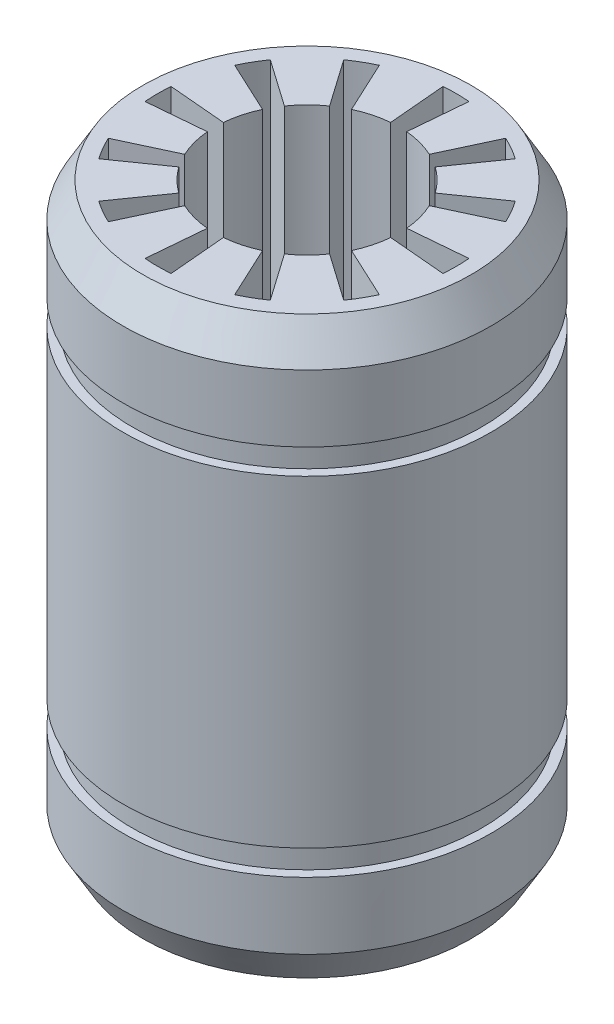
ISO-10303-21;
HEADER;
FILE_DESCRIPTION(('STEP AP214'),'2;1');
FILE_NAME('part.step','',(''),(''),'','','');
FILE_SCHEMA(('AUTOMOTIVE_DESIGN { 1 0 10303 214 1 1 1 1 }'));
ENDSEC;
DATA;
#1=APPLICATION_CONTEXT('core data for automotive mechanical design processes');
#2=APPLICATION_PROTOCOL_DEFINITION('international standard','automotive_design',2000,#1);
#3=PRODUCT_CONTEXT('',#1,'mechanical');
#4=PRODUCT('Part','Part','',(#3));
#5=PRODUCT_RELATED_PRODUCT_CATEGORY('part','',(#4));
#6=PRODUCT_DEFINITION_FORMATION('','',#4);
#7=PRODUCT_DEFINITION_CONTEXT('part definition',#1,'design');
#8=PRODUCT_DEFINITION('design','',#6,#7);
#9=PRODUCT_DEFINITION_SHAPE('','',#8);
#10=(LENGTH_UNIT() NAMED_UNIT(*) SI_UNIT(.MILLI.,.METRE.));
#11=(NAMED_UNIT(*) PLANE_ANGLE_UNIT() SI_UNIT($,.RADIAN.));
#12=(NAMED_UNIT(*) SI_UNIT($,.STERADIAN.) SOLID_ANGLE_UNIT());
#13=UNCERTAINTY_MEASURE_WITH_UNIT(LENGTH_MEASURE(1.E-05),#10,'distance_accuracy_value','');
#14=(GEOMETRIC_REPRESENTATION_CONTEXT(3) GLOBAL_UNCERTAINTY_ASSIGNED_CONTEXT((#13)) GLOBAL_UNIT_ASSIGNED_CONTEXT((#10,
#11,#12)) REPRESENTATION_CONTEXT('',''));
#15=CARTESIAN_POINT('',(0.,0.,0.));
#16=DIRECTION('',(0.,0.,1.));
#17=DIRECTION('',(1.,0.,0.));
#18=AXIS2_PLACEMENT_3D('',#15,#16,#17);
#19=CARTESIAN_POINT('',(0.,0.,0.));
#20=DIRECTION('',(0.,-1.,0.));
#21=DIRECTION('',(0.,0.,-1.));
#22=AXIS2_PLACEMENT_3D('',#19,#20,#21);
#23=CYLINDRICAL_SURFACE('',#22,4.);
#24=CARTESIAN_POINT('',(0.,12.5,0.));
#25=DIRECTION('',(0.,-1.,0.));
#26=DIRECTION('',(0.,0.,-1.));
#27=AXIS2_PLACEMENT_3D('',#24,#25,#26);
#28=CIRCLE('',#27,4.);
#29=CARTESIAN_POINT('',(1.69047304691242,12.5,3.62523114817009));
#30=VERTEX_POINT('',#29);
#31=CARTESIAN_POINT('',(0.348622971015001,12.5,3.98477879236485));
#32=VERTEX_POINT('',#31);
#33=EDGE_CURVE('E328',#30,#32,#28,.T.);
#34=ORIENTED_EDGE('',*,*,#33,.F.);
#35=DIRECTION('',(0.,1.,0.));
#36=VECTOR('',#35,1.);
#37=CARTESIAN_POINT('',(1.69047304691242,18.75,3.62523114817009));
#38=LINE('',#37,#36);
#39=CARTESIAN_POINT('',(1.69047304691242,-12.5,3.62523114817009));
#40=VERTEX_POINT('',#39);
#41=EDGE_CURVE('E330',#30,#40,#38,.F.);
#42=ORIENTED_EDGE('',*,*,#41,.T.);
#43=CARTESIAN_POINT('',(0.,-12.5,0.));
#44=DIRECTION('',(0.,-1.,0.));
#45=DIRECTION('',(0.,0.,-1.));
#46=AXIS2_PLACEMENT_3D('',#43,#44,#45);
#47=CIRCLE('',#46,4.);
#48=CARTESIAN_POINT('',(0.348622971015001,-12.5,3.98477879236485));
#49=VERTEX_POINT('',#48);
#50=EDGE_CURVE('E20',#49,#40,#47,.F.);
#51=ORIENTED_EDGE('',*,*,#50,.F.);
#52=DIRECTION('',(0.,1.,0.));
#53=VECTOR('',#52,1.);
#54=CARTESIAN_POINT('',(0.348622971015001,18.75,3.98477879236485));
#55=LINE('',#54,#53);
#56=EDGE_CURVE('E335',#49,#32,#55,.T.);
#57=ORIENTED_EDGE('',*,*,#56,.T.);
#58=EDGE_LOOP('',(#34,#42,#51,#57));
#59=FACE_BOUND('',#58,.T.);
#60=ADVANCED_FACE('F17',(#59),#23,.F.);
#61=CARTESIAN_POINT('',(-1.11658192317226E-13,18.75,-2.1449189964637E-13));
#62=DIRECTION('',(0.,-1.,0.));
#63=DIRECTION('',(0.,0.,-1.));
#64=AXIS2_PLACEMENT_3D('',#61,#62,#63);
#65=CYLINDRICAL_SURFACE('',#64,6.50000000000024);
#66=DIRECTION('',(0.,1.,0.));
#67=VECTOR('',#66,1.);
#68=CARTESIAN_POINT('',(3.72824683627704,18.75,5.32448828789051));
#69=LINE('',#68,#67);
#70=CARTESIAN_POINT('',(3.72824683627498,12.5,5.32448828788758));
#71=VERTEX_POINT('',#70);
#72=CARTESIAN_POINT('',(3.72824683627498,-12.5,5.32448828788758));
#73=VERTEX_POINT('',#72);
#74=EDGE_CURVE('E545',#71,#73,#69,.F.);
#75=ORIENTED_EDGE('',*,*,#74,.T.);
#76=CARTESIAN_POINT('',(-1.11658192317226E-13,-12.5,-2.1449189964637E-13));
#77=DIRECTION('',(0.,-1.,0.));
#78=DIRECTION('',(0.,0.,-1.));
#79=AXIS2_PLACEMENT_3D('',#76,#77,#78);
#80=CIRCLE('',#79,6.50000000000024);
#81=CARTESIAN_POINT('',(2.74701870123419,-12.5,5.89100061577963));
#82=VERTEX_POINT('',#81);
#83=EDGE_CURVE('E673',#82,#73,#80,.F.);
#84=ORIENTED_EDGE('',*,*,#83,.F.);
#85=DIRECTION('',(0.,1.,0.));
#86=VECTOR('',#85,1.);
#87=CARTESIAN_POINT('',(2.7470187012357,18.75,5.89100061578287));
#88=LINE('',#87,#86);
#89=CARTESIAN_POINT('',(2.74701870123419,12.5,5.89100061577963));
#90=VERTEX_POINT('',#89);
#91=EDGE_CURVE('E334',#82,#90,#88,.T.);
#92=ORIENTED_EDGE('',*,*,#91,.T.);
#93=CARTESIAN_POINT('',(-1.11658192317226E-13,12.5,-2.1449189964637E-13));
#94=DIRECTION('',(0.,-1.,0.));
#95=DIRECTION('',(0.,0.,-1.));
#96=AXIS2_PLACEMENT_3D('',#93,#94,#95);
#97=CIRCLE('',#96,6.50000000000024);
#98=EDGE_CURVE('E671',#71,#90,#97,.T.);
#99=ORIENTED_EDGE('',*,*,#98,.F.);
#100=EDGE_LOOP('',(#75,#84,#92,#99));
#101=FACE_BOUND('',#100,.T.);
#102=ADVANCED_FACE('F889',(#101),#65,.F.);
#103=CARTESIAN_POINT('',(0.,0.,0.));
#104=DIRECTION('',(0.,-1.,0.));
#105=DIRECTION('',(0.,0.,-1.));
#106=AXIS2_PLACEMENT_3D('',#103,#104,#105);
#107=CYLINDRICAL_SURFACE('',#106,4.);
#108=CARTESIAN_POINT('',(0.,12.5,0.));
#109=DIRECTION('',(0.,-1.,0.));
#110=DIRECTION('',(0.,0.,-1.));
#111=AXIS2_PLACEMENT_3D('',#108,#109,#110);
#112=CIRCLE('',#111,4.);
#113=CARTESIAN_POINT('',(3.27660817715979,12.5,2.29430574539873));
#114=VERTEX_POINT('',#113);
#115=CARTESIAN_POINT('',(2.29430574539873,12.5,3.27660817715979));
#116=VERTEX_POINT('',#115);
#117=EDGE_CURVE('E667',#114,#116,#112,.T.);
#118=ORIENTED_EDGE('',*,*,#117,.F.);
#119=DIRECTION('',(0.,1.,0.));
#120=VECTOR('',#119,1.);
#121=CARTESIAN_POINT('',(3.27660817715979,18.75,2.29430574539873));
#122=LINE('',#121,#120);
#123=CARTESIAN_POINT('',(3.27660817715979,-12.5,2.29430574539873));
#124=VERTEX_POINT('',#123);
#125=EDGE_CURVE('E539',#114,#124,#122,.F.);
#126=ORIENTED_EDGE('',*,*,#125,.T.);
#127=CARTESIAN_POINT('',(0.,-12.5,0.));
#128=DIRECTION('',(0.,-1.,0.));
#129=DIRECTION('',(0.,0.,-1.));
#130=AXIS2_PLACEMENT_3D('',#127,#128,#129);
#131=CIRCLE('',#130,4.);
#132=CARTESIAN_POINT('',(2.29430574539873,-12.5,3.27660817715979));
#133=VERTEX_POINT('',#132);
#134=EDGE_CURVE('E669',#133,#124,#131,.F.);
#135=ORIENTED_EDGE('',*,*,#134,.F.);
#136=DIRECTION('',(0.,1.,0.));
#137=VECTOR('',#136,1.);
#138=CARTESIAN_POINT('',(2.29430574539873,18.75,3.27660817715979));
#139=LINE('',#138,#137);
#140=EDGE_CURVE('E542',#133,#116,#139,.T.);
#141=ORIENTED_EDGE('',*,*,#140,.T.);
#142=EDGE_LOOP('',(#118,#126,#135,#141));
#143=FACE_BOUND('',#142,.T.);
#144=ADVANCED_FACE('F881',(#143),#107,.F.);
#145=CARTESIAN_POINT('',(-2.03944780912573E-13,18.75,-1.29926337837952E-13));
#146=DIRECTION('',(0.,-1.,0.));
#147=DIRECTION('',(0.,0.,-1.));
#148=AXIS2_PLACEMENT_3D('',#145,#146,#147);
#149=CYLINDRICAL_SURFACE('',#148,6.50000000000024);
#150=DIRECTION('',(0.,1.,0.));
#151=VECTOR('',#150,1.);
#152=CARTESIAN_POINT('',(5.89100061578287,18.75,2.7470187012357));
#153=LINE('',#152,#151);
#154=CARTESIAN_POINT('',(5.89100061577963,12.5,2.74701870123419));
#155=VERTEX_POINT('',#154);
#156=CARTESIAN_POINT('',(5.89100061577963,-12.5,2.74701870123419));
#157=VERTEX_POINT('',#156);
#158=EDGE_CURVE('E533',#155,#157,#153,.F.);
#159=ORIENTED_EDGE('',*,*,#158,.T.);
#160=CARTESIAN_POINT('',(-2.03944780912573E-13,-12.5,-1.29926337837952E-13));
#161=DIRECTION('',(0.,-1.,0.));
#162=DIRECTION('',(0.,0.,-1.));
#163=AXIS2_PLACEMENT_3D('',#160,#161,#162);
#164=CIRCLE('',#163,6.50000000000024);
#165=CARTESIAN_POINT('',(5.32448828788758,-12.5,3.72824683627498));
#166=VERTEX_POINT('',#165);
#167=EDGE_CURVE('E665',#166,#157,#164,.F.);
#168=ORIENTED_EDGE('',*,*,#167,.F.);
#169=DIRECTION('',(0.,1.,0.));
#170=VECTOR('',#169,1.);
#171=CARTESIAN_POINT('',(5.32448828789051,18.75,3.72824683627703));
#172=LINE('',#171,#170);
#173=CARTESIAN_POINT('',(5.32448828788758,12.5,3.72824683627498));
#174=VERTEX_POINT('',#173);
#175=EDGE_CURVE('E536',#166,#174,#172,.T.);
#176=ORIENTED_EDGE('',*,*,#175,.T.);
#177=CARTESIAN_POINT('',(-2.03944780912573E-13,12.5,-1.29926337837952E-13));
#178=DIRECTION('',(0.,-1.,0.));
#179=DIRECTION('',(0.,0.,-1.));
#180=AXIS2_PLACEMENT_3D('',#177,#178,#179);
#181=CIRCLE('',#180,6.50000000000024);
#182=EDGE_CURVE('E663',#155,#174,#181,.T.);
#183=ORIENTED_EDGE('',*,*,#182,.F.);
#184=EDGE_LOOP('',(#159,#168,#176,#183));
#185=FACE_BOUND('',#184,.T.);
#186=ADVANCED_FACE('F874',(#185),#149,.F.);
#187=CARTESIAN_POINT('',(0.,0.,0.));
#188=DIRECTION('',(0.,-1.,0.));
#189=DIRECTION('',(0.,0.,-1.));
#190=AXIS2_PLACEMENT_3D('',#187,#188,#189);
#191=CYLINDRICAL_SURFACE('',#190,4.);
#192=CARTESIAN_POINT('',(0.,12.5,0.));
#193=DIRECTION('',(0.,-1.,0.));
#194=DIRECTION('',(0.,0.,-1.));
#195=AXIS2_PLACEMENT_3D('',#192,#193,#194);
#196=CIRCLE('',#195,4.);
#197=CARTESIAN_POINT('',(3.98477879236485,12.5,0.348622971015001));
#198=VERTEX_POINT('',#197);
#199=CARTESIAN_POINT('',(3.62523114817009,12.5,1.69047304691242));
#200=VERTEX_POINT('',#199);
#201=EDGE_CURVE('E659',#198,#200,#196,.T.);
#202=ORIENTED_EDGE('',*,*,#201,.F.);
#203=DIRECTION('',(0.,1.,0.));
#204=VECTOR('',#203,1.);
#205=CARTESIAN_POINT('',(3.98477879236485,18.75,0.348622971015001));
#206=LINE('',#205,#204);
#207=CARTESIAN_POINT('',(3.98477879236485,-12.5,0.348622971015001));
#208=VERTEX_POINT('',#207);
#209=EDGE_CURVE('E527',#198,#208,#206,.F.);
#210=ORIENTED_EDGE('',*,*,#209,.T.);
#211=CARTESIAN_POINT('',(0.,-12.5,0.));
#212=DIRECTION('',(0.,-1.,0.));
#213=DIRECTION('',(0.,0.,-1.));
#214=AXIS2_PLACEMENT_3D('',#211,#212,#213);
#215=CIRCLE('',#214,4.);
#216=CARTESIAN_POINT('',(3.62523114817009,-12.5,1.69047304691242));
#217=VERTEX_POINT('',#216);
#218=EDGE_CURVE('E661',#217,#208,#215,.F.);
#219=ORIENTED_EDGE('',*,*,#218,.F.);
#220=DIRECTION('',(0.,1.,0.));
#221=VECTOR('',#220,1.);
#222=CARTESIAN_POINT('',(3.62523114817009,18.75,1.69047304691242));
#223=LINE('',#222,#221);
#224=EDGE_CURVE('E530',#217,#200,#223,.T.);
#225=ORIENTED_EDGE('',*,*,#224,.T.);
#226=EDGE_LOOP('',(#202,#210,#219,#225));
#227=FACE_BOUND('',#226,.T.);
#228=ADVANCED_FACE('F863',(#227),#191,.F.);
#229=CARTESIAN_POINT('',(-2.41584530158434E-13,18.75,0.));
#230=DIRECTION('',(0.,-1.,0.));
#231=DIRECTION('',(0.,0.,-1.));
#232=AXIS2_PLACEMENT_3D('',#229,#230,#231);
#233=CYLINDRICAL_SURFACE('',#232,6.50000000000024);
#234=DIRECTION('',(0.,1.,0.));
#235=VECTOR('',#234,1.);
#236=CARTESIAN_POINT('',(6.4752655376,18.75,-0.5665123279));
#237=LINE('',#236,#235);
#238=CARTESIAN_POINT('',(6.47526553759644,12.5,-0.566512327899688));
#239=VERTEX_POINT('',#238);
#240=CARTESIAN_POINT('',(6.47526553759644,-12.5,-0.566512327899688));
#241=VERTEX_POINT('',#240);
#242=EDGE_CURVE('E521',#239,#241,#237,.F.);
#243=ORIENTED_EDGE('',*,*,#242,.T.);
#244=CARTESIAN_POINT('',(-2.41584530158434E-13,-12.5,0.));
#245=DIRECTION('',(0.,-1.,0.));
#246=DIRECTION('',(0.,0.,-1.));
#247=AXIS2_PLACEMENT_3D('',#244,#245,#246);
#248=CIRCLE('',#247,6.50000000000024);
#249=CARTESIAN_POINT('',(6.47526553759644,-12.5,0.566512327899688));
#250=VERTEX_POINT('',#249);
#251=EDGE_CURVE('E657',#250,#241,#248,.F.);
#252=ORIENTED_EDGE('',*,*,#251,.F.);
#253=DIRECTION('',(0.,1.,0.));
#254=VECTOR('',#253,1.);
#255=CARTESIAN_POINT('',(6.4752655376,18.75,0.5665123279));
#256=LINE('',#255,#254);
#257=CARTESIAN_POINT('',(6.47526553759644,12.5,0.566512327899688));
#258=VERTEX_POINT('',#257);
#259=EDGE_CURVE('E524',#250,#258,#256,.T.);
#260=ORIENTED_EDGE('',*,*,#259,.T.);
#261=CARTESIAN_POINT('',(-2.41584530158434E-13,12.5,0.));
#262=DIRECTION('',(0.,-1.,0.));
#263=DIRECTION('',(0.,0.,-1.));
#264=AXIS2_PLACEMENT_3D('',#261,#262,#263);
#265=CIRCLE('',#264,6.50000000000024);
#266=EDGE_CURVE('E655',#239,#258,#265,.T.);
#267=ORIENTED_EDGE('',*,*,#266,.F.);
#268=EDGE_LOOP('',(#243,#252,#260,#267));
#269=FACE_BOUND('',#268,.T.);
#270=ADVANCED_FACE('F853',(#269),#233,.F.);
#271=CARTESIAN_POINT('',(0.,0.,0.));
#272=DIRECTION('',(0.,-1.,0.));
#273=DIRECTION('',(0.,0.,-1.));
#274=AXIS2_PLACEMENT_3D('',#271,#272,#273);
#275=CYLINDRICAL_SURFACE('',#274,4.);
#276=CARTESIAN_POINT('',(0.,12.5,0.));
#277=DIRECTION('',(0.,-1.,0.));
#278=DIRECTION('',(0.,0.,-1.));
#279=AXIS2_PLACEMENT_3D('',#276,#277,#278);
#280=CIRCLE('',#279,4.);
#281=CARTESIAN_POINT('',(3.62523114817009,12.5,-1.69047304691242));
#282=VERTEX_POINT('',#281);
#283=CARTESIAN_POINT('',(3.98477879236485,12.5,-0.348622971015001));
#284=VERTEX_POINT('',#283);
#285=EDGE_CURVE('E651',#282,#284,#280,.T.);
#286=ORIENTED_EDGE('',*,*,#285,.F.);
#287=DIRECTION('',(0.,1.,0.));
#288=VECTOR('',#287,1.);
#289=CARTESIAN_POINT('',(3.62523114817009,18.75,-1.69047304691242));
#290=LINE('',#289,#288);
#291=CARTESIAN_POINT('',(3.62523114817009,-12.5,-1.69047304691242));
#292=VERTEX_POINT('',#291);
#293=EDGE_CURVE('E515',#282,#292,#290,.F.);
#294=ORIENTED_EDGE('',*,*,#293,.T.);
#295=CARTESIAN_POINT('',(0.,-12.5,0.));
#296=DIRECTION('',(0.,-1.,0.));
#297=DIRECTION('',(0.,0.,-1.));
#298=AXIS2_PLACEMENT_3D('',#295,#296,#297);
#299=CIRCLE('',#298,4.);
#300=CARTESIAN_POINT('',(3.98477879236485,-12.5,-0.348622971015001));
#301=VERTEX_POINT('',#300);
#302=EDGE_CURVE('E653',#301,#292,#299,.F.);
#303=ORIENTED_EDGE('',*,*,#302,.F.);
#304=DIRECTION('',(0.,1.,0.));
#305=VECTOR('',#304,1.);
#306=CARTESIAN_POINT('',(3.98477879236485,18.75,-0.348622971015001));
#307=LINE('',#306,#305);
#308=EDGE_CURVE('E518',#301,#284,#307,.T.);
#309=ORIENTED_EDGE('',*,*,#308,.T.);
#310=EDGE_LOOP('',(#286,#294,#303,#309));
#311=FACE_BOUND('',#310,.T.);
#312=ADVANCED_FACE('F845',(#311),#275,.F.);
#313=CARTESIAN_POINT('',(-2.1449189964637E-13,18.75,1.11658192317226E-13));
#314=DIRECTION('',(0.,-1.,0.));
#315=DIRECTION('',(0.,0.,-1.));
#316=AXIS2_PLACEMENT_3D('',#313,#314,#315);
#317=CYLINDRICAL_SURFACE('',#316,6.50000000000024);
#318=DIRECTION('',(0.,1.,0.));
#319=VECTOR('',#318,1.);
#320=CARTESIAN_POINT('',(5.32448828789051,18.75,-3.72824683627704));
#321=LINE('',#320,#319);
#322=CARTESIAN_POINT('',(5.32448828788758,12.5,-3.72824683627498));
#323=VERTEX_POINT('',#322);
#324=CARTESIAN_POINT('',(5.32448828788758,-12.5,-3.72824683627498));
#325=VERTEX_POINT('',#324);
#326=EDGE_CURVE('E509',#323,#325,#321,.F.);
#327=ORIENTED_EDGE('',*,*,#326,.T.);
#328=CARTESIAN_POINT('',(-2.1449189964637E-13,-12.5,1.11658192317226E-13));
#329=DIRECTION('',(0.,-1.,0.));
#330=DIRECTION('',(0.,0.,-1.));
#331=AXIS2_PLACEMENT_3D('',#328,#329,#330);
#332=CIRCLE('',#331,6.50000000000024);
#333=CARTESIAN_POINT('',(5.89100061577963,-12.5,-2.74701870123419));
#334=VERTEX_POINT('',#333);
#335=EDGE_CURVE('E649',#334,#325,#332,.F.);
#336=ORIENTED_EDGE('',*,*,#335,.F.);
#337=DIRECTION('',(0.,1.,0.));
#338=VECTOR('',#337,1.);
#339=CARTESIAN_POINT('',(5.89100061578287,18.75,-2.7470187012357));
#340=LINE('',#339,#338);
#341=CARTESIAN_POINT('',(5.89100061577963,12.5,-2.74701870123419));
#342=VERTEX_POINT('',#341);
#343=EDGE_CURVE('E512',#334,#342,#340,.T.);
#344=ORIENTED_EDGE('',*,*,#343,.T.);
#345=CARTESIAN_POINT('',(-2.1449189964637E-13,12.5,1.11658192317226E-13));
#346=DIRECTION('',(0.,-1.,0.));
#347=DIRECTION('',(0.,0.,-1.));
#348=AXIS2_PLACEMENT_3D('',#345,#346,#347);
#349=CIRCLE('',#348,6.50000000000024);
#350=EDGE_CURVE('E647',#323,#342,#349,.T.);
#351=ORIENTED_EDGE('',*,*,#350,.F.);
#352=EDGE_LOOP('',(#327,#336,#344,#351));
#353=FACE_BOUND('',#352,.T.);
#354=ADVANCED_FACE('F834',(#353),#317,.F.);
#355=CARTESIAN_POINT('',(0.,0.,0.));
#356=DIRECTION('',(0.,-1.,0.));
#357=DIRECTION('',(0.,0.,-1.));
#358=AXIS2_PLACEMENT_3D('',#355,#356,#357);
#359=CYLINDRICAL_SURFACE('',#358,4.);
#360=CARTESIAN_POINT('',(0.,12.5,0.));
#361=DIRECTION('',(0.,-1.,0.));
#362=DIRECTION('',(0.,0.,-1.));
#363=AXIS2_PLACEMENT_3D('',#360,#361,#362);
#364=CIRCLE('',#363,4.);
#365=CARTESIAN_POINT('',(2.29430574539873,12.5,-3.27660817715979));
#366=VERTEX_POINT('',#365);
#367=CARTESIAN_POINT('',(3.27660817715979,12.5,-2.29430574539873));
#368=VERTEX_POINT('',#367);
#369=EDGE_CURVE('E643',#366,#368,#364,.T.);
#370=ORIENTED_EDGE('',*,*,#369,.F.);
#371=DIRECTION('',(0.,1.,0.));
#372=VECTOR('',#371,1.);
#373=CARTESIAN_POINT('',(2.29430574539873,18.75,-3.27660817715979));
#374=LINE('',#373,#372);
#375=CARTESIAN_POINT('',(2.29430574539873,-12.5,-3.27660817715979));
#376=VERTEX_POINT('',#375);
#377=EDGE_CURVE('E503',#366,#376,#374,.F.);
#378=ORIENTED_EDGE('',*,*,#377,.T.);
#379=CARTESIAN_POINT('',(0.,-12.5,0.));
#380=DIRECTION('',(0.,-1.,0.));
#381=DIRECTION('',(0.,0.,-1.));
#382=AXIS2_PLACEMENT_3D('',#379,#380,#381);
#383=CIRCLE('',#382,4.);
#384=CARTESIAN_POINT('',(3.27660817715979,-12.5,-2.29430574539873));
#385=VERTEX_POINT('',#384);
#386=EDGE_CURVE('E645',#385,#376,#383,.F.);
#387=ORIENTED_EDGE('',*,*,#386,.F.);
#388=DIRECTION('',(0.,1.,0.));
#389=VECTOR('',#388,1.);
#390=CARTESIAN_POINT('',(3.27660817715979,18.75,-2.29430574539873));
#391=LINE('',#390,#389);
#392=EDGE_CURVE('E506',#385,#368,#391,.T.);
#393=ORIENTED_EDGE('',*,*,#392,.T.);
#394=EDGE_LOOP('',(#370,#378,#387,#393));
#395=FACE_BOUND('',#394,.T.);
#396=ADVANCED_FACE('F824',(#395),#359,.F.);
#397=CARTESIAN_POINT('',(-1.29926337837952E-13,18.75,2.03944780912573E-13));
#398=DIRECTION('',(0.,-1.,0.));
#399=DIRECTION('',(0.,0.,-1.));
#400=AXIS2_PLACEMENT_3D('',#397,#398,#399);
#401=CYLINDRICAL_SURFACE('',#400,6.50000000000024);
#402=DIRECTION('',(0.,1.,0.));
#403=VECTOR('',#402,1.);
#404=CARTESIAN_POINT('',(2.7470187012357,18.75,-5.89100061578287));
#405=LINE('',#404,#403);
#406=CARTESIAN_POINT('',(2.74701870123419,12.5,-5.89100061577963));
#407=VERTEX_POINT('',#406);
#408=CARTESIAN_POINT('',(2.74701870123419,-12.5,-5.89100061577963));
#409=VERTEX_POINT('',#408);
#410=EDGE_CURVE('E497',#407,#409,#405,.F.);
#411=ORIENTED_EDGE('',*,*,#410,.T.);
#412=CARTESIAN_POINT('',(-1.29926337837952E-13,-12.5,2.03944780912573E-13));
#413=DIRECTION('',(0.,-1.,0.));
#414=DIRECTION('',(0.,0.,-1.));
#415=AXIS2_PLACEMENT_3D('',#412,#413,#414);
#416=CIRCLE('',#415,6.50000000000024);
#417=CARTESIAN_POINT('',(3.72824683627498,-12.5,-5.32448828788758));
#418=VERTEX_POINT('',#417);
#419=EDGE_CURVE('E641',#418,#409,#416,.F.);
#420=ORIENTED_EDGE('',*,*,#419,.F.);
#421=DIRECTION('',(0.,1.,0.));
#422=VECTOR('',#421,1.);
#423=CARTESIAN_POINT('',(3.72824683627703,18.75,-5.32448828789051));
#424=LINE('',#423,#422);
#425=CARTESIAN_POINT('',(3.72824683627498,12.5,-5.32448828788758));
#426=VERTEX_POINT('',#425);
#427=EDGE_CURVE('E500',#418,#426,#424,.T.);
#428=ORIENTED_EDGE('',*,*,#427,.T.);
#429=CARTESIAN_POINT('',(-1.29926337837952E-13,12.5,2.03944780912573E-13));
#430=DIRECTION('',(0.,-1.,0.));
#431=DIRECTION('',(0.,0.,-1.));
#432=AXIS2_PLACEMENT_3D('',#429,#430,#431);
#433=CIRCLE('',#432,6.50000000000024);
#434=EDGE_CURVE('E639',#407,#426,#433,.T.);
#435=ORIENTED_EDGE('',*,*,#434,.F.);
#436=EDGE_LOOP('',(#411,#420,#428,#435));
#437=FACE_BOUND('',#436,.T.);
#438=ADVANCED_FACE('F816',(#437),#401,.F.);
#439=CARTESIAN_POINT('',(0.,0.,0.));
#440=DIRECTION('',(0.,-1.,0.));
#441=DIRECTION('',(0.,0.,-1.));
#442=AXIS2_PLACEMENT_3D('',#439,#440,#441);
#443=CYLINDRICAL_SURFACE('',#442,4.);
#444=CARTESIAN_POINT('',(0.,12.5,0.));
#445=DIRECTION('',(0.,-1.,0.));
#446=DIRECTION('',(0.,0.,-1.));
#447=AXIS2_PLACEMENT_3D('',#444,#445,#446);
#448=CIRCLE('',#447,4.);
#449=CARTESIAN_POINT('',(0.348622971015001,12.5,-3.98477879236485));
#450=VERTEX_POINT('',#449);
#451=CARTESIAN_POINT('',(1.69047304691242,12.5,-3.62523114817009));
#452=VERTEX_POINT('',#451);
#453=EDGE_CURVE('E635',#450,#452,#448,.T.);
#454=ORIENTED_EDGE('',*,*,#453,.F.);
#455=DIRECTION('',(0.,1.,0.));
#456=VECTOR('',#455,1.);
#457=CARTESIAN_POINT('',(0.348622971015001,18.75,-3.98477879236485));
#458=LINE('',#457,#456);
#459=CARTESIAN_POINT('',(0.348622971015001,-12.5,-3.98477879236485));
#460=VERTEX_POINT('',#459);
#461=EDGE_CURVE('E491',#450,#460,#458,.F.);
#462=ORIENTED_EDGE('',*,*,#461,.T.);
#463=CARTESIAN_POINT('',(0.,-12.5,0.));
#464=DIRECTION('',(0.,-1.,0.));
#465=DIRECTION('',(0.,0.,-1.));
#466=AXIS2_PLACEMENT_3D('',#463,#464,#465);
#467=CIRCLE('',#466,4.);
#468=CARTESIAN_POINT('',(1.69047304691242,-12.5,-3.62523114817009));
#469=VERTEX_POINT('',#468);
#470=EDGE_CURVE('E637',#469,#460,#467,.F.);
#471=ORIENTED_EDGE('',*,*,#470,.F.);
#472=DIRECTION('',(0.,1.,0.));
#473=VECTOR('',#472,1.);
#474=CARTESIAN_POINT('',(1.69047304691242,18.75,-3.62523114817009));
#475=LINE('',#474,#473);
#476=EDGE_CURVE('E494',#469,#452,#475,.T.);
#477=ORIENTED_EDGE('',*,*,#476,.T.);
#478=EDGE_LOOP('',(#454,#462,#471,#477));
#479=FACE_BOUND('',#478,.T.);
#480=ADVANCED_FACE('F805',(#479),#443,.F.);
#481=CARTESIAN_POINT('',(0.,18.75,2.41584530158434E-13));
#482=DIRECTION('',(0.,-1.,0.));
#483=DIRECTION('',(0.,0.,-1.));
#484=AXIS2_PLACEMENT_3D('',#481,#482,#483);
#485=CYLINDRICAL_SURFACE('',#484,6.50000000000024);
#486=DIRECTION('',(0.,1.,0.));
#487=VECTOR('',#486,1.);
#488=CARTESIAN_POINT('',(-0.5665123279,18.75,-6.4752655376));
#489=LINE('',#488,#487);
#490=CARTESIAN_POINT('',(-0.566512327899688,12.5,-6.47526553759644));
#491=VERTEX_POINT('',#490);
#492=CARTESIAN_POINT('',(-0.566512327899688,-12.5,-6.47526553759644));
#493=VERTEX_POINT('',#492);
#494=EDGE_CURVE('E485',#491,#493,#489,.F.);
#495=ORIENTED_EDGE('',*,*,#494,.T.);
#496=CARTESIAN_POINT('',(0.,-12.5,2.41584530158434E-13));
#497=DIRECTION('',(0.,-1.,0.));
#498=DIRECTION('',(0.,0.,-1.));
#499=AXIS2_PLACEMENT_3D('',#496,#497,#498);
#500=CIRCLE('',#499,6.50000000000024);
#501=CARTESIAN_POINT('',(0.566512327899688,-12.5,-6.47526553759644));
#502=VERTEX_POINT('',#501);
#503=EDGE_CURVE('E633',#502,#493,#500,.F.);
#504=ORIENTED_EDGE('',*,*,#503,.F.);
#505=DIRECTION('',(0.,1.,0.));
#506=VECTOR('',#505,1.);
#507=CARTESIAN_POINT('',(0.5665123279,18.75,-6.4752655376));
#508=LINE('',#507,#506);
#509=CARTESIAN_POINT('',(0.566512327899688,12.5,-6.47526553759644));
#510=VERTEX_POINT('',#509);
#511=EDGE_CURVE('E488',#502,#510,#508,.T.);
#512=ORIENTED_EDGE('',*,*,#511,.T.);
#513=CARTESIAN_POINT('',(0.,12.5,2.41584530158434E-13));
#514=DIRECTION('',(0.,-1.,0.));
#515=DIRECTION('',(0.,0.,-1.));
#516=AXIS2_PLACEMENT_3D('',#513,#514,#515);
#517=CIRCLE('',#516,6.50000000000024);
#518=EDGE_CURVE('E631',#491,#510,#517,.T.);
#519=ORIENTED_EDGE('',*,*,#518,.F.);
#520=EDGE_LOOP('',(#495,#504,#512,#519));
#521=FACE_BOUND('',#520,.T.);
#522=ADVANCED_FACE('F795',(#521),#485,.F.);
#523=CARTESIAN_POINT('',(0.,0.,0.));
#524=DIRECTION('',(0.,-1.,0.));
#525=DIRECTION('',(0.,0.,-1.));
#526=AXIS2_PLACEMENT_3D('',#523,#524,#525);
#527=CYLINDRICAL_SURFACE('',#526,4.);
#528=CARTESIAN_POINT('',(0.,12.5,0.));
#529=DIRECTION('',(0.,-1.,0.));
#530=DIRECTION('',(0.,0.,-1.));
#531=AXIS2_PLACEMENT_3D('',#528,#529,#530);
#532=CIRCLE('',#531,4.);
#533=CARTESIAN_POINT('',(-1.69047304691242,12.5,-3.62523114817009));
#534=VERTEX_POINT('',#533);
#535=CARTESIAN_POINT('',(-0.348622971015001,12.5,-3.98477879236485));
#536=VERTEX_POINT('',#535);
#537=EDGE_CURVE('E627',#534,#536,#532,.T.);
#538=ORIENTED_EDGE('',*,*,#537,.F.);
#539=DIRECTION('',(0.,1.,0.));
#540=VECTOR('',#539,1.);
#541=CARTESIAN_POINT('',(-1.69047304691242,18.75,-3.62523114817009));
#542=LINE('',#541,#540);
#543=CARTESIAN_POINT('',(-1.69047304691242,-12.5,-3.62523114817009));
#544=VERTEX_POINT('',#543);
#545=EDGE_CURVE('E479',#534,#544,#542,.F.);
#546=ORIENTED_EDGE('',*,*,#545,.T.);
#547=CARTESIAN_POINT('',(0.,-12.5,0.));
#548=DIRECTION('',(0.,-1.,0.));
#549=DIRECTION('',(0.,0.,-1.));
#550=AXIS2_PLACEMENT_3D('',#547,#548,#549);
#551=CIRCLE('',#550,4.);
#552=CARTESIAN_POINT('',(-0.348622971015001,-12.5,-3.98477879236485));
#553=VERTEX_POINT('',#552);
#554=EDGE_CURVE('E629',#553,#544,#551,.F.);
#555=ORIENTED_EDGE('',*,*,#554,.F.);
#556=DIRECTION('',(0.,1.,0.));
#557=VECTOR('',#556,1.);
#558=CARTESIAN_POINT('',(-0.348622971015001,18.75,-3.98477879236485));
#559=LINE('',#558,#557);
#560=EDGE_CURVE('E482',#553,#536,#559,.T.);
#561=ORIENTED_EDGE('',*,*,#560,.T.);
#562=EDGE_LOOP('',(#538,#546,#555,#561));
#563=FACE_BOUND('',#562,.T.);
#564=ADVANCED_FACE('F787',(#563),#527,.F.);
#565=CARTESIAN_POINT('',(1.11658192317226E-13,18.75,2.1449189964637E-13));
#566=DIRECTION('',(0.,-1.,0.));
#567=DIRECTION('',(0.,0.,-1.));
#568=AXIS2_PLACEMENT_3D('',#565,#566,#567);
#569=CYLINDRICAL_SURFACE('',#568,6.50000000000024);
#570=DIRECTION('',(0.,1.,0.));
#571=VECTOR('',#570,1.);
#572=CARTESIAN_POINT('',(-3.72824683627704,18.75,-5.32448828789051));
#573=LINE('',#572,#571);
#574=CARTESIAN_POINT('',(-3.72824683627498,12.5,-5.32448828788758));
#575=VERTEX_POINT('',#574);
#576=CARTESIAN_POINT('',(-3.72824683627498,-12.5,-5.32448828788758));
#577=VERTEX_POINT('',#576);
#578=EDGE_CURVE('E473',#575,#577,#573,.F.);
#579=ORIENTED_EDGE('',*,*,#578,.T.);
#580=CARTESIAN_POINT('',(1.11658192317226E-13,-12.5,2.1449189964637E-13));
#581=DIRECTION('',(0.,-1.,0.));
#582=DIRECTION('',(0.,0.,-1.));
#583=AXIS2_PLACEMENT_3D('',#580,#581,#582);
#584=CIRCLE('',#583,6.50000000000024);
#585=CARTESIAN_POINT('',(-2.74701870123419,-12.5,-5.89100061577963));
#586=VERTEX_POINT('',#585);
#587=EDGE_CURVE('E625',#586,#577,#584,.F.);
#588=ORIENTED_EDGE('',*,*,#587,.F.);
#589=DIRECTION('',(0.,1.,0.));
#590=VECTOR('',#589,1.);
#591=CARTESIAN_POINT('',(-2.7470187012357,18.75,-5.89100061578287));
#592=LINE('',#591,#590);
#593=CARTESIAN_POINT('',(-2.74701870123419,12.5,-5.89100061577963));
#594=VERTEX_POINT('',#593);
#595=EDGE_CURVE('E476',#586,#594,#592,.T.);
#596=ORIENTED_EDGE('',*,*,#595,.T.);
#597=CARTESIAN_POINT('',(1.11658192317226E-13,12.5,2.1449189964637E-13));
#598=DIRECTION('',(0.,-1.,0.));
#599=DIRECTION('',(0.,0.,-1.));
#600=AXIS2_PLACEMENT_3D('',#597,#598,#599);
#601=CIRCLE('',#600,6.50000000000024);
#602=EDGE_CURVE('E623',#575,#594,#601,.T.);
#603=ORIENTED_EDGE('',*,*,#602,.F.);
#604=EDGE_LOOP('',(#579,#588,#596,#603));
#605=FACE_BOUND('',#604,.T.);
#606=ADVANCED_FACE('F776',(#605),#569,.F.);
#607=CARTESIAN_POINT('',(0.,0.,0.));
#608=DIRECTION('',(0.,-1.,0.));
#609=DIRECTION('',(0.,0.,-1.));
#610=AXIS2_PLACEMENT_3D('',#607,#608,#609);
#611=CYLINDRICAL_SURFACE('',#610,4.);
#612=CARTESIAN_POINT('',(0.,12.5,0.));
#613=DIRECTION('',(0.,-1.,0.));
#614=DIRECTION('',(0.,0.,-1.));
#615=AXIS2_PLACEMENT_3D('',#612,#613,#614);
#616=CIRCLE('',#615,4.);
#617=CARTESIAN_POINT('',(-3.27660817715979,12.5,-2.29430574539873));
#618=VERTEX_POINT('',#617);
#619=CARTESIAN_POINT('',(-2.29430574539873,12.5,-3.27660817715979));
#620=VERTEX_POINT('',#619);
#621=EDGE_CURVE('E619',#618,#620,#616,.T.);
#622=ORIENTED_EDGE('',*,*,#621,.F.);
#623=DIRECTION('',(0.,1.,0.));
#624=VECTOR('',#623,1.);
#625=CARTESIAN_POINT('',(-3.27660817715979,18.75,-2.29430574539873));
#626=LINE('',#625,#624);
#627=CARTESIAN_POINT('',(-3.27660817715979,-12.5,-2.29430574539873));
#628=VERTEX_POINT('',#627);
#629=EDGE_CURVE('E467',#618,#628,#626,.F.);
#630=ORIENTED_EDGE('',*,*,#629,.T.);
#631=CARTESIAN_POINT('',(0.,-12.5,0.));
#632=DIRECTION('',(0.,-1.,0.));
#633=DIRECTION('',(0.,0.,-1.));
#634=AXIS2_PLACEMENT_3D('',#631,#632,#633);
#635=CIRCLE('',#634,4.);
#636=CARTESIAN_POINT('',(-2.29430574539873,-12.5,-3.27660817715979));
#637=VERTEX_POINT('',#636);
#638=EDGE_CURVE('E621',#637,#628,#635,.F.);
#639=ORIENTED_EDGE('',*,*,#638,.F.);
#640=DIRECTION('',(0.,1.,0.));
#641=VECTOR('',#640,1.);
#642=CARTESIAN_POINT('',(-2.29430574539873,18.75,-3.27660817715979));
#643=LINE('',#642,#641);
#644=EDGE_CURVE('E470',#637,#620,#643,.T.);
#645=ORIENTED_EDGE('',*,*,#644,.T.);
#646=EDGE_LOOP('',(#622,#630,#639,#645));
#647=FACE_BOUND('',#646,.T.);
#648=ADVANCED_FACE('F766',(#647),#611,.F.);
#649=CARTESIAN_POINT('',(2.03944780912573E-13,18.75,1.29926337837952E-13));
#650=DIRECTION('',(0.,-1.,0.));
#651=DIRECTION('',(0.,0.,-1.));
#652=AXIS2_PLACEMENT_3D('',#649,#650,#651);
#653=CYLINDRICAL_SURFACE('',#652,6.50000000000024);
#654=DIRECTION('',(0.,1.,0.));
#655=VECTOR('',#654,1.);
#656=CARTESIAN_POINT('',(-5.89100061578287,18.75,-2.7470187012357));
#657=LINE('',#656,#655);
#658=CARTESIAN_POINT('',(-5.89100061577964,12.5,-2.74701870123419));
#659=VERTEX_POINT('',#658);
#660=CARTESIAN_POINT('',(-5.89100061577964,-12.5,-2.74701870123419));
#661=VERTEX_POINT('',#660);
#662=EDGE_CURVE('E461',#659,#661,#657,.F.);
#663=ORIENTED_EDGE('',*,*,#662,.T.);
#664=CARTESIAN_POINT('',(2.03944780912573E-13,-12.5,1.29926337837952E-13));
#665=DIRECTION('',(0.,-1.,0.));
#666=DIRECTION('',(0.,0.,-1.));
#667=AXIS2_PLACEMENT_3D('',#664,#665,#666);
#668=CIRCLE('',#667,6.50000000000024);
#669=CARTESIAN_POINT('',(-5.32448828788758,-12.5,-3.72824683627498));
#670=VERTEX_POINT('',#669);
#671=EDGE_CURVE('E617',#670,#661,#668,.F.);
#672=ORIENTED_EDGE('',*,*,#671,.F.);
#673=DIRECTION('',(0.,1.,0.));
#674=VECTOR('',#673,1.);
#675=CARTESIAN_POINT('',(-5.32448828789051,18.75,-3.72824683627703));
#676=LINE('',#675,#674);
#677=CARTESIAN_POINT('',(-5.32448828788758,12.5,-3.72824683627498));
#678=VERTEX_POINT('',#677);
#679=EDGE_CURVE('E464',#670,#678,#676,.T.);
#680=ORIENTED_EDGE('',*,*,#679,.T.);
#681=CARTESIAN_POINT('',(2.03944780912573E-13,12.5,1.29926337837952E-13));
#682=DIRECTION('',(0.,-1.,0.));
#683=DIRECTION('',(0.,0.,-1.));
#684=AXIS2_PLACEMENT_3D('',#681,#682,#683);
#685=CIRCLE('',#684,6.50000000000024);
#686=EDGE_CURVE('E615',#659,#678,#685,.T.);
#687=ORIENTED_EDGE('',*,*,#686,.F.);
#688=EDGE_LOOP('',(#663,#672,#680,#687));
#689=FACE_BOUND('',#688,.T.);
#690=ADVANCED_FACE('F758',(#689),#653,.F.);
#691=CARTESIAN_POINT('',(0.,0.,0.));
#692=DIRECTION('',(0.,-1.,0.));
#693=DIRECTION('',(0.,0.,-1.));
#694=AXIS2_PLACEMENT_3D('',#691,#692,#693);
#695=CYLINDRICAL_SURFACE('',#694,4.);
#696=CARTESIAN_POINT('',(0.,12.5,0.));
#697=DIRECTION('',(0.,-1.,0.));
#698=DIRECTION('',(0.,0.,-1.));
#699=AXIS2_PLACEMENT_3D('',#696,#697,#698);
#700=CIRCLE('',#699,4.);
#701=CARTESIAN_POINT('',(-3.98477879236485,12.5,-0.348622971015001));
#702=VERTEX_POINT('',#701);
#703=CARTESIAN_POINT('',(-3.62523114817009,12.5,-1.69047304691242));
#704=VERTEX_POINT('',#703);
#705=EDGE_CURVE('E611',#702,#704,#700,.T.);
#706=ORIENTED_EDGE('',*,*,#705,.F.);
#707=DIRECTION('',(0.,1.,0.));
#708=VECTOR('',#707,1.);
#709=CARTESIAN_POINT('',(-3.98477879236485,18.75,-0.348622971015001));
#710=LINE('',#709,#708);
#711=CARTESIAN_POINT('',(-3.98477879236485,-12.5,-0.348622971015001));
#712=VERTEX_POINT('',#711);
#713=EDGE_CURVE('E455',#702,#712,#710,.F.);
#714=ORIENTED_EDGE('',*,*,#713,.T.);
#715=CARTESIAN_POINT('',(0.,-12.5,0.));
#716=DIRECTION('',(0.,-1.,0.));
#717=DIRECTION('',(0.,0.,-1.));
#718=AXIS2_PLACEMENT_3D('',#715,#716,#717);
#719=CIRCLE('',#718,4.);
#720=CARTESIAN_POINT('',(-3.62523114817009,-12.5,-1.69047304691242));
#721=VERTEX_POINT('',#720);
#722=EDGE_CURVE('E613',#721,#712,#719,.F.);
#723=ORIENTED_EDGE('',*,*,#722,.F.);
#724=DIRECTION('',(0.,1.,0.));
#725=VECTOR('',#724,1.);
#726=CARTESIAN_POINT('',(-3.62523114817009,18.75,-1.69047304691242));
#727=LINE('',#726,#725);
#728=EDGE_CURVE('E458',#721,#704,#727,.T.);
#729=ORIENTED_EDGE('',*,*,#728,.T.);
#730=EDGE_LOOP('',(#706,#714,#723,#729));
#731=FACE_BOUND('',#730,.T.);
#732=ADVANCED_FACE('F747',(#731),#695,.F.);
#733=CARTESIAN_POINT('',(2.41584530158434E-13,18.75,0.));
#734=DIRECTION('',(0.,-1.,0.));
#735=DIRECTION('',(0.,0.,-1.));
#736=AXIS2_PLACEMENT_3D('',#733,#734,#735);
#737=CYLINDRICAL_SURFACE('',#736,6.50000000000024);
#738=DIRECTION('',(0.,1.,0.));
#739=VECTOR('',#738,1.);
#740=CARTESIAN_POINT('',(-6.4752655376,18.75,0.5665123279));
#741=LINE('',#740,#739);
#742=CARTESIAN_POINT('',(-6.47526553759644,12.5,0.566512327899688));
#743=VERTEX_POINT('',#742);
#744=CARTESIAN_POINT('',(-6.47526553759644,-12.5,0.566512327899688));
#745=VERTEX_POINT('',#744);
#746=EDGE_CURVE('E449',#743,#745,#741,.F.);
#747=ORIENTED_EDGE('',*,*,#746,.T.);
#748=CARTESIAN_POINT('',(2.41584530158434E-13,-12.5,0.));
#749=DIRECTION('',(0.,-1.,0.));
#750=DIRECTION('',(0.,0.,-1.));
#751=AXIS2_PLACEMENT_3D('',#748,#749,#750);
#752=CIRCLE('',#751,6.50000000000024);
#753=CARTESIAN_POINT('',(-6.47526553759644,-12.5,-0.566512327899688));
#754=VERTEX_POINT('',#753);
#755=EDGE_CURVE('E609',#754,#745,#752,.F.);
#756=ORIENTED_EDGE('',*,*,#755,.F.);
#757=DIRECTION('',(0.,1.,0.));
#758=VECTOR('',#757,1.);
#759=CARTESIAN_POINT('',(-6.4752655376,18.75,-0.5665123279));
#760=LINE('',#759,#758);
#761=CARTESIAN_POINT('',(-6.47526553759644,12.5,-0.566512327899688));
#762=VERTEX_POINT('',#761);
#763=EDGE_CURVE('E452',#754,#762,#760,.T.);
#764=ORIENTED_EDGE('',*,*,#763,.T.);
#765=CARTESIAN_POINT('',(2.41584530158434E-13,12.5,0.));
#766=DIRECTION('',(0.,-1.,0.));
#767=DIRECTION('',(0.,0.,-1.));
#768=AXIS2_PLACEMENT_3D('',#765,#766,#767);
#769=CIRCLE('',#768,6.50000000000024);
#770=EDGE_CURVE('E607',#743,#762,#769,.T.);
#771=ORIENTED_EDGE('',*,*,#770,.F.);
#772=EDGE_LOOP('',(#747,#756,#764,#771));
#773=FACE_BOUND('',#772,.T.);
#774=ADVANCED_FACE('F737',(#773),#737,.F.);
#775=CARTESIAN_POINT('',(0.,0.,0.));
#776=DIRECTION('',(0.,-1.,0.));
#777=DIRECTION('',(0.,0.,-1.));
#778=AXIS2_PLACEMENT_3D('',#775,#776,#777);
#779=CYLINDRICAL_SURFACE('',#778,4.);
#780=CARTESIAN_POINT('',(0.,12.5,0.));
#781=DIRECTION('',(0.,-1.,0.));
#782=DIRECTION('',(0.,0.,-1.));
#783=AXIS2_PLACEMENT_3D('',#780,#781,#782);
#784=CIRCLE('',#783,4.);
#785=CARTESIAN_POINT('',(-3.62523114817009,12.5,1.69047304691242));
#786=VERTEX_POINT('',#785);
#787=CARTESIAN_POINT('',(-3.98477879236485,12.5,0.348622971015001));
#788=VERTEX_POINT('',#787);
#789=EDGE_CURVE('E603',#786,#788,#784,.T.);
#790=ORIENTED_EDGE('',*,*,#789,.F.);
#791=DIRECTION('',(0.,1.,0.));
#792=VECTOR('',#791,1.);
#793=CARTESIAN_POINT('',(-3.62523114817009,18.75,1.69047304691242));
#794=LINE('',#793,#792);
#795=CARTESIAN_POINT('',(-3.62523114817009,-12.5,1.69047304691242));
#796=VERTEX_POINT('',#795);
#797=EDGE_CURVE('E443',#786,#796,#794,.F.);
#798=ORIENTED_EDGE('',*,*,#797,.T.);
#799=CARTESIAN_POINT('',(0.,-12.5,0.));
#800=DIRECTION('',(0.,-1.,0.));
#801=DIRECTION('',(0.,0.,-1.));
#802=AXIS2_PLACEMENT_3D('',#799,#800,#801);
#803=CIRCLE('',#802,4.);
#804=CARTESIAN_POINT('',(-3.98477879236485,-12.5,0.348622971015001));
#805=VERTEX_POINT('',#804);
#806=EDGE_CURVE('E605',#805,#796,#803,.F.);
#807=ORIENTED_EDGE('',*,*,#806,.F.);
#808=DIRECTION('',(0.,1.,0.));
#809=VECTOR('',#808,1.);
#810=CARTESIAN_POINT('',(-3.98477879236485,18.75,0.348622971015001));
#811=LINE('',#810,#809);
#812=EDGE_CURVE('E446',#805,#788,#811,.T.);
#813=ORIENTED_EDGE('',*,*,#812,.T.);
#814=EDGE_LOOP('',(#790,#798,#807,#813));
#815=FACE_BOUND('',#814,.T.);
#816=ADVANCED_FACE('F729',(#815),#779,.F.);
#817=CARTESIAN_POINT('',(2.1449189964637E-13,18.75,-1.11658192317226E-13));
#818=DIRECTION('',(0.,-1.,0.));
#819=DIRECTION('',(0.,0.,-1.));
#820=AXIS2_PLACEMENT_3D('',#817,#818,#819);
#821=CYLINDRICAL_SURFACE('',#820,6.50000000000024);
#822=DIRECTION('',(0.,1.,0.));
#823=VECTOR('',#822,1.);
#824=CARTESIAN_POINT('',(-5.32448828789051,18.75,3.72824683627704));
#825=LINE('',#824,#823);
#826=CARTESIAN_POINT('',(-5.32448828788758,12.5,3.72824683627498));
#827=VERTEX_POINT('',#826);
#828=CARTESIAN_POINT('',(-5.32448828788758,-12.5,3.72824683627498));
#829=VERTEX_POINT('',#828);
#830=EDGE_CURVE('E437',#827,#829,#825,.F.);
#831=ORIENTED_EDGE('',*,*,#830,.T.);
#832=CARTESIAN_POINT('',(2.1449189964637E-13,-12.5,-1.11658192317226E-13));
#833=DIRECTION('',(0.,-1.,0.));
#834=DIRECTION('',(0.,0.,-1.));
#835=AXIS2_PLACEMENT_3D('',#832,#833,#834);
#836=CIRCLE('',#835,6.50000000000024);
#837=CARTESIAN_POINT('',(-5.89100061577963,-12.5,2.74701870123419));
#838=VERTEX_POINT('',#837);
#839=EDGE_CURVE('E601',#838,#829,#836,.F.);
#840=ORIENTED_EDGE('',*,*,#839,.F.);
#841=DIRECTION('',(0.,1.,0.));
#842=VECTOR('',#841,1.);
#843=CARTESIAN_POINT('',(-5.89100061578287,18.75,2.7470187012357));
#844=LINE('',#843,#842);
#845=CARTESIAN_POINT('',(-5.89100061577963,12.5,2.74701870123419));
#846=VERTEX_POINT('',#845);
#847=EDGE_CURVE('E440',#838,#846,#844,.T.);
#848=ORIENTED_EDGE('',*,*,#847,.T.);
#849=CARTESIAN_POINT('',(2.1449189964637E-13,12.5,-1.11658192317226E-13));
#850=DIRECTION('',(0.,-1.,0.));
#851=DIRECTION('',(0.,0.,-1.));
#852=AXIS2_PLACEMENT_3D('',#849,#850,#851);
#853=CIRCLE('',#852,6.50000000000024);
#854=EDGE_CURVE('E599',#827,#846,#853,.T.);
#855=ORIENTED_EDGE('',*,*,#854,.F.);
#856=EDGE_LOOP('',(#831,#840,#848,#855));
#857=FACE_BOUND('',#856,.T.);
#858=ADVANCED_FACE('F718',(#857),#821,.F.);
#859=CARTESIAN_POINT('',(0.,0.,0.));
#860=DIRECTION('',(0.,-1.,0.));
#861=DIRECTION('',(0.,0.,-1.));
#862=AXIS2_PLACEMENT_3D('',#859,#860,#861);
#863=CYLINDRICAL_SURFACE('',#862,4.);
#864=CARTESIAN_POINT('',(0.,12.5,0.));
#865=DIRECTION('',(0.,-1.,0.));
#866=DIRECTION('',(0.,0.,-1.));
#867=AXIS2_PLACEMENT_3D('',#864,#865,#866);
#868=CIRCLE('',#867,4.);
#869=CARTESIAN_POINT('',(-2.29430574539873,12.5,3.27660817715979));
#870=VERTEX_POINT('',#869);
#871=CARTESIAN_POINT('',(-3.27660817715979,12.5,2.29430574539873));
#872=VERTEX_POINT('',#871);
#873=EDGE_CURVE('E595',#870,#872,#868,.T.);
#874=ORIENTED_EDGE('',*,*,#873,.F.);
#875=DIRECTION('',(0.,1.,0.));
#876=VECTOR('',#875,1.);
#877=CARTESIAN_POINT('',(-2.29430574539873,18.75,3.27660817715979));
#878=LINE('',#877,#876);
#879=CARTESIAN_POINT('',(-2.29430574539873,-12.5,3.27660817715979));
#880=VERTEX_POINT('',#879);
#881=EDGE_CURVE('E431',#870,#880,#878,.F.);
#882=ORIENTED_EDGE('',*,*,#881,.T.);
#883=CARTESIAN_POINT('',(0.,-12.5,0.));
#884=DIRECTION('',(0.,-1.,0.));
#885=DIRECTION('',(0.,0.,-1.));
#886=AXIS2_PLACEMENT_3D('',#883,#884,#885);
#887=CIRCLE('',#886,4.);
#888=CARTESIAN_POINT('',(-3.27660817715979,-12.5,2.29430574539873));
#889=VERTEX_POINT('',#888);
#890=EDGE_CURVE('E597',#889,#880,#887,.F.);
#891=ORIENTED_EDGE('',*,*,#890,.F.);
#892=DIRECTION('',(0.,1.,0.));
#893=VECTOR('',#892,1.);
#894=CARTESIAN_POINT('',(-3.27660817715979,18.75,2.29430574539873));
#895=LINE('',#894,#893);
#896=EDGE_CURVE('E434',#889,#872,#895,.T.);
#897=ORIENTED_EDGE('',*,*,#896,.T.);
#898=EDGE_LOOP('',(#874,#882,#891,#897));
#899=FACE_BOUND('',#898,.T.);
#900=ADVANCED_FACE('F708',(#899),#863,.F.);
#901=CARTESIAN_POINT('',(1.29926337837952E-13,18.75,-2.03944780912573E-13));
#902=DIRECTION('',(0.,-1.,0.));
#903=DIRECTION('',(0.,0.,-1.));
#904=AXIS2_PLACEMENT_3D('',#901,#902,#903);
#905=CYLINDRICAL_SURFACE('',#904,6.50000000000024);
#906=DIRECTION('',(0.,1.,0.));
#907=VECTOR('',#906,1.);
#908=CARTESIAN_POINT('',(-2.7470187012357,18.75,5.89100061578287));
#909=LINE('',#908,#907);
#910=CARTESIAN_POINT('',(-2.74701870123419,12.5,5.89100061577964));
#911=VERTEX_POINT('',#910);
#912=CARTESIAN_POINT('',(-2.74701870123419,-12.5,5.89100061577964));
#913=VERTEX_POINT('',#912);
#914=EDGE_CURVE('E425',#911,#913,#909,.F.);
#915=ORIENTED_EDGE('',*,*,#914,.T.);
#916=CARTESIAN_POINT('',(1.29926337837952E-13,-12.5,-2.03944780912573E-13));
#917=DIRECTION('',(0.,-1.,0.));
#918=DIRECTION('',(0.,0.,-1.));
#919=AXIS2_PLACEMENT_3D('',#916,#917,#918);
#920=CIRCLE('',#919,6.50000000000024);
#921=CARTESIAN_POINT('',(-3.72824683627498,-12.5,5.32448828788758));
#922=VERTEX_POINT('',#921);
#923=EDGE_CURVE('E593',#922,#913,#920,.F.);
#924=ORIENTED_EDGE('',*,*,#923,.F.);
#925=DIRECTION('',(0.,1.,0.));
#926=VECTOR('',#925,1.);
#927=CARTESIAN_POINT('',(-3.72824683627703,18.75,5.32448828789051));
#928=LINE('',#927,#926);
#929=CARTESIAN_POINT('',(-3.72824683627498,12.5,5.32448828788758));
#930=VERTEX_POINT('',#929);
#931=EDGE_CURVE('E428',#922,#930,#928,.T.);
#932=ORIENTED_EDGE('',*,*,#931,.T.);
#933=CARTESIAN_POINT('',(1.29926337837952E-13,12.5,-2.03944780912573E-13));
#934=DIRECTION('',(0.,-1.,0.));
#935=DIRECTION('',(0.,0.,-1.));
#936=AXIS2_PLACEMENT_3D('',#933,#934,#935);
#937=CIRCLE('',#936,6.50000000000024);
#938=EDGE_CURVE('E591',#911,#930,#937,.T.);
#939=ORIENTED_EDGE('',*,*,#938,.F.);
#940=EDGE_LOOP('',(#915,#924,#932,#939));
#941=FACE_BOUND('',#940,.T.);
#942=ADVANCED_FACE('F700',(#941),#905,.F.);
#943=CARTESIAN_POINT('',(0.,0.,0.));
#944=DIRECTION('',(0.,-1.,0.));
#945=DIRECTION('',(0.,0.,-1.));
#946=AXIS2_PLACEMENT_3D('',#943,#944,#945);
#947=CYLINDRICAL_SURFACE('',#946,4.);
#948=CARTESIAN_POINT('',(0.,-12.5,0.));
#949=DIRECTION('',(0.,-1.,0.));
#950=DIRECTION('',(0.,0.,-1.));
#951=AXIS2_PLACEMENT_3D('',#948,#949,#950);
#952=CIRCLE('',#951,4.);
#953=CARTESIAN_POINT('',(-1.69047304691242,-12.5,3.62523114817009));
#954=VERTEX_POINT('',#953);
#955=CARTESIAN_POINT('',(-0.348622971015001,-12.5,3.98477879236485));
#956=VERTEX_POINT('',#955);
#957=EDGE_CURVE('E587',#954,#956,#952,.F.);
#958=ORIENTED_EDGE('',*,*,#957,.F.);
#959=DIRECTION('',(0.,1.,0.));
#960=VECTOR('',#959,1.);
#961=CARTESIAN_POINT('',(-1.69047304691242,18.75,3.62523114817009));
#962=LINE('',#961,#960);
#963=CARTESIAN_POINT('',(-1.69047304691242,12.5,3.62523114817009));
#964=VERTEX_POINT('',#963);
#965=EDGE_CURVE('E423',#954,#964,#962,.T.);
#966=ORIENTED_EDGE('',*,*,#965,.T.);
#967=CARTESIAN_POINT('',(0.,12.5,0.));
#968=DIRECTION('',(0.,-1.,0.));
#969=DIRECTION('',(0.,0.,-1.));
#970=AXIS2_PLACEMENT_3D('',#967,#968,#969);
#971=CIRCLE('',#970,4.);
#972=CARTESIAN_POINT('',(-0.348622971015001,12.5,3.98477879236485));
#973=VERTEX_POINT('',#972);
#974=EDGE_CURVE('E589',#973,#964,#971,.T.);
#975=ORIENTED_EDGE('',*,*,#974,.F.);
#976=DIRECTION('',(0.,1.,0.));
#977=VECTOR('',#976,1.);
#978=CARTESIAN_POINT('',(-0.348622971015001,18.75,3.98477879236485));
#979=LINE('',#978,#977);
#980=EDGE_CURVE('E420',#973,#956,#979,.F.);
#981=ORIENTED_EDGE('',*,*,#980,.T.);
#982=EDGE_LOOP('',(#958,#966,#975,#981));
#983=FACE_BOUND('',#982,.T.);
#984=ADVANCED_FACE('F689',(#983),#947,.F.);
#985=CARTESIAN_POINT('',(0.,18.75,-2.41584530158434E-13));
#986=DIRECTION('',(0.,-1.,0.));
#987=DIRECTION('',(0.,0.,-1.));
#988=AXIS2_PLACEMENT_3D('',#985,#986,#987);
#989=CYLINDRICAL_SURFACE('',#988,6.50000000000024);
#990=DIRECTION('',(0.,1.,0.));
#991=VECTOR('',#990,1.);
#992=CARTESIAN_POINT('',(0.5665123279,18.75,6.4752655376));
#993=LINE('',#992,#991);
#994=CARTESIAN_POINT('',(0.566512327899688,12.5,6.47526553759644));
#995=VERTEX_POINT('',#994);
#996=CARTESIAN_POINT('',(0.566512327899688,-12.5,6.47526553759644));
#997=VERTEX_POINT('',#996);
#998=EDGE_CURVE('E551',#995,#997,#993,.F.);
#999=ORIENTED_EDGE('',*,*,#998,.T.);
#1000=CARTESIAN_POINT('',(0.,-12.5,-2.41584530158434E-13));
#1001=DIRECTION('',(0.,-1.,0.));
#1002=DIRECTION('',(0.,0.,-1.));
#1003=AXIS2_PLACEMENT_3D('',#1000,#1001,#1002);
#1004=CIRCLE('',#1003,6.50000000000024);
#1005=CARTESIAN_POINT('',(-0.566512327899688,-12.5,6.47526553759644));
#1006=VERTEX_POINT('',#1005);
#1007=EDGE_CURVE('E35',#1006,#997,#1004,.F.);
#1008=ORIENTED_EDGE('',*,*,#1007,.F.);
#1009=DIRECTION('',(0.,1.,0.));
#1010=VECTOR('',#1009,1.);
#1011=CARTESIAN_POINT('',(-0.5665123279,18.75,6.4752655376));
#1012=LINE('',#1011,#1010);
#1013=CARTESIAN_POINT('',(-0.566512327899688,12.5,6.47526553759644));
#1014=VERTEX_POINT('',#1013);
#1015=EDGE_CURVE('E419',#1006,#1014,#1012,.T.);
#1016=ORIENTED_EDGE('',*,*,#1015,.T.);
#1017=CARTESIAN_POINT('',(0.,12.5,-2.41584530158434E-13));
#1018=DIRECTION('',(0.,-1.,0.));
#1019=DIRECTION('',(0.,0.,-1.));
#1020=AXIS2_PLACEMENT_3D('',#1017,#1018,#1019);
#1021=CIRCLE('',#1020,6.50000000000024);
#1022=EDGE_CURVE('E553',#995,#1014,#1021,.T.);
#1023=ORIENTED_EDGE('',*,*,#1022,.F.);
#1024=EDGE_LOOP('',(#999,#1008,#1016,#1023));
#1025=FACE_BOUND('',#1024,.T.);
#1026=ADVANCED_FACE('F682',(#1025),#989,.F.);
#1027=CARTESIAN_POINT('',(0.28325616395,18.75,3.2376327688));
#1028=DIRECTION('',(0.996194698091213,0.,-0.0871557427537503));
#1029=DIRECTION('',(-0.0871557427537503,0.,-0.996194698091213));
#1030=AXIS2_PLACEMENT_3D('',#1027,#1028,#1029);
#1031=PLANE('',#1030);
#1032=ORIENTED_EDGE('',*,*,#56,.F.);
#1033=DIRECTION('',(-0.0871557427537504,0.,-0.996194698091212));
#1034=VECTOR('',#1033,1.);
#1035=CARTESIAN_POINT('',(0.5665123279,-12.5,6.4752655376));
#1036=LINE('',#1035,#1034);
#1037=EDGE_CURVE('E327',#997,#49,#1036,.T.);
#1038=ORIENTED_EDGE('',*,*,#1037,.F.);
#1039=ORIENTED_EDGE('',*,*,#998,.F.);
#1040=DIRECTION('',(0.0871557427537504,0.,0.996194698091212));
#1041=VECTOR('',#1040,1.);
#1042=CARTESIAN_POINT('',(0.348622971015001,12.5,3.98477879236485));
#1043=LINE('',#1042,#1041);
#1044=EDGE_CURVE('E416',#32,#995,#1043,.T.);
#1045=ORIENTED_EDGE('',*,*,#1044,.F.);
#1046=EDGE_LOOP('',(#1032,#1038,#1039,#1045));
#1047=FACE_BOUND('',#1046,.T.);
#1048=ADVANCED_FACE('F680',(#1047),#1031,.F.);
#1049=CARTESIAN_POINT('',(1.37350935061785,18.75,2.94550030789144));
#1050=DIRECTION('',(-0.906307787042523,0.,0.422618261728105));
#1051=DIRECTION('',(0.422618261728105,0.,0.906307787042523));
#1052=AXIS2_PLACEMENT_3D('',#1049,#1050,#1051);
#1053=PLANE('',#1052);
#1054=ORIENTED_EDGE('',*,*,#91,.F.);
#1055=DIRECTION('',(0.422618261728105,0.,0.906307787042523));
#1056=VECTOR('',#1055,1.);
#1057=CARTESIAN_POINT('',(1.69047304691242,-12.5,3.62523114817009));
#1058=LINE('',#1057,#1056);
#1059=EDGE_CURVE('E325',#40,#82,#1058,.T.);
#1060=ORIENTED_EDGE('',*,*,#1059,.F.);
#1061=ORIENTED_EDGE('',*,*,#41,.F.);
#1062=DIRECTION('',(-0.422618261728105,0.,-0.906307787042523));
#1063=VECTOR('',#1062,1.);
#1064=CARTESIAN_POINT('',(2.7470187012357,12.5,5.89100061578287));
#1065=LINE('',#1064,#1063);
#1066=EDGE_CURVE('E345',#90,#30,#1065,.T.);
#1067=ORIENTED_EDGE('',*,*,#1066,.F.);
#1068=EDGE_LOOP('',(#1054,#1060,#1061,#1067));
#1069=FACE_BOUND('',#1068,.T.);
#1070=ADVANCED_FACE('F338',(#1069),#1053,.F.);
#1071=CARTESIAN_POINT('',(1.86412341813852,18.75,2.66224414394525));
#1072=DIRECTION('',(0.819152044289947,0.,-0.573576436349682));
#1073=DIRECTION('',(-0.573576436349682,0.,-0.819152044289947));
#1074=AXIS2_PLACEMENT_3D('',#1071,#1072,#1073);
#1075=PLANE('',#1074);
#1076=ORIENTED_EDGE('',*,*,#140,.F.);
#1077=DIRECTION('',(-0.573576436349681,0.,-0.819152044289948));
#1078=VECTOR('',#1077,1.);
#1079=CARTESIAN_POINT('',(3.72824683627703,-12.5,5.32448828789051));
#1080=LINE('',#1079,#1078);
#1081=EDGE_CURVE('E340',#73,#133,#1080,.T.);
#1082=ORIENTED_EDGE('',*,*,#1081,.F.);
#1083=ORIENTED_EDGE('',*,*,#74,.F.);
#1084=DIRECTION('',(0.573576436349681,0.,0.819152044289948));
#1085=VECTOR('',#1084,1.);
#1086=CARTESIAN_POINT('',(2.29430574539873,12.5,3.27660817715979));
#1087=LINE('',#1086,#1085);
#1088=EDGE_CURVE('E350',#116,#71,#1087,.T.);
#1089=ORIENTED_EDGE('',*,*,#1088,.F.);
#1090=EDGE_LOOP('',(#1076,#1082,#1083,#1089));
#1091=FACE_BOUND('',#1090,.T.);
#1092=ADVANCED_FACE('F886',(#1091),#1075,.F.);
#1093=CARTESIAN_POINT('',(2.66224414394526,18.75,1.86412341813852));
#1094=DIRECTION('',(-0.573576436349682,0.,0.819152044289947));
#1095=DIRECTION('',(0.819152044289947,0.,0.573576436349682));
#1096=AXIS2_PLACEMENT_3D('',#1093,#1094,#1095);
#1097=PLANE('',#1096);
#1098=ORIENTED_EDGE('',*,*,#175,.F.);
#1099=DIRECTION('',(0.819152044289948,0.,0.573576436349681));
#1100=VECTOR('',#1099,1.);
#1101=CARTESIAN_POINT('',(3.27660817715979,-12.5,2.29430574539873));
#1102=LINE('',#1101,#1100);
#1103=EDGE_CURVE('E343',#124,#166,#1102,.T.);
#1104=ORIENTED_EDGE('',*,*,#1103,.F.);
#1105=ORIENTED_EDGE('',*,*,#125,.F.);
#1106=DIRECTION('',(-0.819152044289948,0.,-0.573576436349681));
#1107=VECTOR('',#1106,1.);
#1108=CARTESIAN_POINT('',(5.32448828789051,12.5,3.72824683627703));
#1109=LINE('',#1108,#1107);
#1110=EDGE_CURVE('E353',#174,#114,#1109,.T.);
#1111=ORIENTED_EDGE('',*,*,#1110,.F.);
#1112=EDGE_LOOP('',(#1098,#1104,#1105,#1111));
#1113=FACE_BOUND('',#1112,.T.);
#1114=ADVANCED_FACE('F879',(#1113),#1097,.F.);
#1115=CARTESIAN_POINT('',(2.94550030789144,18.75,1.37350935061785));
#1116=DIRECTION('',(0.422618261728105,0.,-0.906307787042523));
#1117=DIRECTION('',(-0.906307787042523,0.,-0.422618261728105));
#1118=AXIS2_PLACEMENT_3D('',#1115,#1116,#1117);
#1119=PLANE('',#1118);
#1120=ORIENTED_EDGE('',*,*,#224,.F.);
#1121=DIRECTION('',(-0.906307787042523,0.,-0.422618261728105));
#1122=VECTOR('',#1121,1.);
#1123=CARTESIAN_POINT('',(5.89100061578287,-12.5,2.7470187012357));
#1124=LINE('',#1123,#1122);
#1125=EDGE_CURVE('E890',#157,#217,#1124,.T.);
#1126=ORIENTED_EDGE('',*,*,#1125,.F.);
#1127=ORIENTED_EDGE('',*,*,#158,.F.);
#1128=DIRECTION('',(0.906307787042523,0.,0.422618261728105));
#1129=VECTOR('',#1128,1.);
#1130=CARTESIAN_POINT('',(3.62523114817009,12.5,1.69047304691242));
#1131=LINE('',#1130,#1129);
#1132=EDGE_CURVE('E356',#200,#155,#1131,.T.);
#1133=ORIENTED_EDGE('',*,*,#1132,.F.);
#1134=EDGE_LOOP('',(#1120,#1126,#1127,#1133));
#1135=FACE_BOUND('',#1134,.T.);
#1136=ADVANCED_FACE('F870',(#1135),#1119,.F.);
#1137=CARTESIAN_POINT('',(3.2376327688,18.75,0.28325616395));
#1138=DIRECTION('',(-0.0871557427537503,0.,0.996194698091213));
#1139=DIRECTION('',(0.996194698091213,0.,0.0871557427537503));
#1140=AXIS2_PLACEMENT_3D('',#1137,#1138,#1139);
#1141=PLANE('',#1140);
#1142=ORIENTED_EDGE('',*,*,#259,.F.);
#1143=DIRECTION('',(0.996194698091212,0.,0.0871557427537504));
#1144=VECTOR('',#1143,1.);
#1145=CARTESIAN_POINT('',(3.98477879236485,-12.5,0.348622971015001));
#1146=LINE('',#1145,#1144);
#1147=EDGE_CURVE('E861',#208,#250,#1146,.T.);
#1148=ORIENTED_EDGE('',*,*,#1147,.F.);
#1149=ORIENTED_EDGE('',*,*,#209,.F.);
#1150=DIRECTION('',(-0.996194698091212,0.,-0.0871557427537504));
#1151=VECTOR('',#1150,1.);
#1152=CARTESIAN_POINT('',(6.4752655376,12.5,0.5665123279));
#1153=LINE('',#1152,#1151);
#1154=EDGE_CURVE('E359',#258,#198,#1153,.T.);
#1155=ORIENTED_EDGE('',*,*,#1154,.F.);
#1156=EDGE_LOOP('',(#1142,#1148,#1149,#1155));
#1157=FACE_BOUND('',#1156,.T.);
#1158=ADVANCED_FACE('F858',(#1157),#1141,.F.);
#1159=CARTESIAN_POINT('',(3.2376327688,18.75,-0.28325616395));
#1160=DIRECTION('',(-0.0871557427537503,0.,-0.996194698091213));
#1161=DIRECTION('',(-0.996194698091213,0.,0.0871557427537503));
#1162=AXIS2_PLACEMENT_3D('',#1159,#1160,#1161);
#1163=PLANE('',#1162);
#1164=ORIENTED_EDGE('',*,*,#308,.F.);
#1165=DIRECTION('',(-0.996194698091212,0.,0.0871557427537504));
#1166=VECTOR('',#1165,1.);
#1167=CARTESIAN_POINT('',(6.4752655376,-12.5,-0.5665123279));
#1168=LINE('',#1167,#1166);
#1169=EDGE_CURVE('E851',#241,#301,#1168,.T.);
#1170=ORIENTED_EDGE('',*,*,#1169,.F.);
#1171=ORIENTED_EDGE('',*,*,#242,.F.);
#1172=DIRECTION('',(0.996194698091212,0.,-0.0871557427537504));
#1173=VECTOR('',#1172,1.);
#1174=CARTESIAN_POINT('',(3.98477879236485,12.5,-0.348622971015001));
#1175=LINE('',#1174,#1173);
#1176=EDGE_CURVE('E362',#284,#239,#1175,.T.);
#1177=ORIENTED_EDGE('',*,*,#1176,.F.);
#1178=EDGE_LOOP('',(#1164,#1170,#1171,#1177));
#1179=FACE_BOUND('',#1178,.T.);
#1180=ADVANCED_FACE('F850',(#1179),#1163,.F.);
#1181=CARTESIAN_POINT('',(2.94550030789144,18.75,-1.37350935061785));
#1182=DIRECTION('',(0.422618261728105,0.,0.906307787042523));
#1183=DIRECTION('',(0.906307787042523,0.,-0.422618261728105));
#1184=AXIS2_PLACEMENT_3D('',#1181,#1182,#1183);
#1185=PLANE('',#1184);
#1186=ORIENTED_EDGE('',*,*,#343,.F.);
#1187=DIRECTION('',(0.906307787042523,0.,-0.422618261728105));
#1188=VECTOR('',#1187,1.);
#1189=CARTESIAN_POINT('',(3.62523114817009,-12.5,-1.69047304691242));
#1190=LINE('',#1189,#1188);
#1191=EDGE_CURVE('E895',#292,#334,#1190,.T.);
#1192=ORIENTED_EDGE('',*,*,#1191,.F.);
#1193=ORIENTED_EDGE('',*,*,#293,.F.);
#1194=DIRECTION('',(-0.906307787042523,0.,0.422618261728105));
#1195=VECTOR('',#1194,1.);
#1196=CARTESIAN_POINT('',(5.89100061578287,12.5,-2.7470187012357));
#1197=LINE('',#1196,#1195);
#1198=EDGE_CURVE('E365',#342,#282,#1197,.T.);
#1199=ORIENTED_EDGE('',*,*,#1198,.F.);
#1200=EDGE_LOOP('',(#1186,#1192,#1193,#1199));
#1201=FACE_BOUND('',#1200,.T.);
#1202=ADVANCED_FACE('F841',(#1201),#1185,.F.);
#1203=CARTESIAN_POINT('',(2.66224414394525,18.75,-1.86412341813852));
#1204=DIRECTION('',(-0.573576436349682,0.,-0.819152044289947));
#1205=DIRECTION('',(-0.819152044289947,0.,0.573576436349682));
#1206=AXIS2_PLACEMENT_3D('',#1203,#1204,#1205);
#1207=PLANE('',#1206);
#1208=ORIENTED_EDGE('',*,*,#392,.F.);
#1209=DIRECTION('',(-0.819152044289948,0.,0.573576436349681));
#1210=VECTOR('',#1209,1.);
#1211=CARTESIAN_POINT('',(5.32448828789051,-12.5,-3.72824683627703));
#1212=LINE('',#1211,#1210);
#1213=EDGE_CURVE('E832',#325,#385,#1212,.T.);
#1214=ORIENTED_EDGE('',*,*,#1213,.F.);
#1215=ORIENTED_EDGE('',*,*,#326,.F.);
#1216=DIRECTION('',(0.819152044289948,0.,-0.573576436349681));
#1217=VECTOR('',#1216,1.);
#1218=CARTESIAN_POINT('',(3.27660817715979,12.5,-2.29430574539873));
#1219=LINE('',#1218,#1217);
#1220=EDGE_CURVE('E368',#368,#323,#1219,.T.);
#1221=ORIENTED_EDGE('',*,*,#1220,.F.);
#1222=EDGE_LOOP('',(#1208,#1214,#1215,#1221));
#1223=FACE_BOUND('',#1222,.T.);
#1224=ADVANCED_FACE('F829',(#1223),#1207,.F.);
#1225=CARTESIAN_POINT('',(1.86412341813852,18.75,-2.66224414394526));
#1226=DIRECTION('',(0.819152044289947,0.,0.573576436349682));
#1227=DIRECTION('',(0.573576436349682,0.,-0.819152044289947));
#1228=AXIS2_PLACEMENT_3D('',#1225,#1226,#1227);
#1229=PLANE('',#1228);
#1230=ORIENTED_EDGE('',*,*,#427,.F.);
#1231=DIRECTION('',(0.573576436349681,0.,-0.819152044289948));
#1232=VECTOR('',#1231,1.);
#1233=CARTESIAN_POINT('',(2.29430574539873,-12.5,-3.27660817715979));
#1234=LINE('',#1233,#1232);
#1235=EDGE_CURVE('E822',#376,#418,#1234,.T.);
#1236=ORIENTED_EDGE('',*,*,#1235,.F.);
#1237=ORIENTED_EDGE('',*,*,#377,.F.);
#1238=DIRECTION('',(-0.573576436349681,0.,0.819152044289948));
#1239=VECTOR('',#1238,1.);
#1240=CARTESIAN_POINT('',(3.72824683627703,12.5,-5.32448828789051));
#1241=LINE('',#1240,#1239);
#1242=EDGE_CURVE('E371',#426,#366,#1241,.T.);
#1243=ORIENTED_EDGE('',*,*,#1242,.F.);
#1244=EDGE_LOOP('',(#1230,#1236,#1237,#1243));
#1245=FACE_BOUND('',#1244,.T.);
#1246=ADVANCED_FACE('F821',(#1245),#1229,.F.);
#1247=CARTESIAN_POINT('',(1.37350935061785,18.75,-2.94550030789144));
#1248=DIRECTION('',(-0.906307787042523,0.,-0.422618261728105));
#1249=DIRECTION('',(-0.422618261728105,0.,0.906307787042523));
#1250=AXIS2_PLACEMENT_3D('',#1247,#1248,#1249);
#1251=PLANE('',#1250);
#1252=ORIENTED_EDGE('',*,*,#476,.F.);
#1253=DIRECTION('',(-0.422618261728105,0.,0.906307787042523));
#1254=VECTOR('',#1253,1.);
#1255=CARTESIAN_POINT('',(2.7470187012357,-12.5,-5.89100061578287));
#1256=LINE('',#1255,#1254);
#1257=EDGE_CURVE('E899',#409,#469,#1256,.T.);
#1258=ORIENTED_EDGE('',*,*,#1257,.F.);
#1259=ORIENTED_EDGE('',*,*,#410,.F.);
#1260=DIRECTION('',(0.422618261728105,0.,-0.906307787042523));
#1261=VECTOR('',#1260,1.);
#1262=CARTESIAN_POINT('',(1.69047304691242,12.5,-3.62523114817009));
#1263=LINE('',#1262,#1261);
#1264=EDGE_CURVE('E374',#452,#407,#1263,.T.);
#1265=ORIENTED_EDGE('',*,*,#1264,.F.);
#1266=EDGE_LOOP('',(#1252,#1258,#1259,#1265));
#1267=FACE_BOUND('',#1266,.T.);
#1268=ADVANCED_FACE('F812',(#1267),#1251,.F.);
#1269=CARTESIAN_POINT('',(0.28325616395,18.75,-3.2376327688));
#1270=DIRECTION('',(0.996194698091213,0.,0.0871557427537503));
#1271=DIRECTION('',(0.0871557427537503,0.,-0.996194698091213));
#1272=AXIS2_PLACEMENT_3D('',#1269,#1270,#1271);
#1273=PLANE('',#1272);
#1274=ORIENTED_EDGE('',*,*,#511,.F.);
#1275=DIRECTION('',(0.0871557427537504,0.,-0.996194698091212));
#1276=VECTOR('',#1275,1.);
#1277=CARTESIAN_POINT('',(0.348622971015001,-12.5,-3.98477879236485));
#1278=LINE('',#1277,#1276);
#1279=EDGE_CURVE('E803',#460,#502,#1278,.T.);
#1280=ORIENTED_EDGE('',*,*,#1279,.F.);
#1281=ORIENTED_EDGE('',*,*,#461,.F.);
#1282=DIRECTION('',(-0.0871557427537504,0.,0.996194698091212));
#1283=VECTOR('',#1282,1.);
#1284=CARTESIAN_POINT('',(0.5665123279,12.5,-6.4752655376));
#1285=LINE('',#1284,#1283);
#1286=EDGE_CURVE('E377',#510,#450,#1285,.T.);
#1287=ORIENTED_EDGE('',*,*,#1286,.F.);
#1288=EDGE_LOOP('',(#1274,#1280,#1281,#1287));
#1289=FACE_BOUND('',#1288,.T.);
#1290=ADVANCED_FACE('F800',(#1289),#1273,.F.);
#1291=CARTESIAN_POINT('',(-0.28325616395,18.75,-3.2376327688));
#1292=DIRECTION('',(-0.996194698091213,0.,0.0871557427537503));
#1293=DIRECTION('',(0.0871557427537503,0.,0.996194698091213));
#1294=AXIS2_PLACEMENT_3D('',#1291,#1292,#1293);
#1295=PLANE('',#1294);
#1296=ORIENTED_EDGE('',*,*,#560,.F.);
#1297=DIRECTION('',(0.0871557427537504,0.,0.996194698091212));
#1298=VECTOR('',#1297,1.);
#1299=CARTESIAN_POINT('',(-0.5665123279,-12.5,-6.4752655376));
#1300=LINE('',#1299,#1298);
#1301=EDGE_CURVE('E793',#493,#553,#1300,.T.);
#1302=ORIENTED_EDGE('',*,*,#1301,.F.);
#1303=ORIENTED_EDGE('',*,*,#494,.F.);
#1304=DIRECTION('',(-0.0871557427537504,0.,-0.996194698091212));
#1305=VECTOR('',#1304,1.);
#1306=CARTESIAN_POINT('',(-0.348622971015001,12.5,-3.98477879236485));
#1307=LINE('',#1306,#1305);
#1308=EDGE_CURVE('E380',#536,#491,#1307,.T.);
#1309=ORIENTED_EDGE('',*,*,#1308,.F.);
#1310=EDGE_LOOP('',(#1296,#1302,#1303,#1309));
#1311=FACE_BOUND('',#1310,.T.);
#1312=ADVANCED_FACE('F792',(#1311),#1295,.F.);
#1313=CARTESIAN_POINT('',(-1.37350935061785,18.75,-2.94550030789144));
#1314=DIRECTION('',(0.906307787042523,0.,-0.422618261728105));
#1315=DIRECTION('',(-0.422618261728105,0.,-0.906307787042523));
#1316=AXIS2_PLACEMENT_3D('',#1313,#1314,#1315);
#1317=PLANE('',#1316);
#1318=ORIENTED_EDGE('',*,*,#595,.F.);
#1319=DIRECTION('',(-0.422618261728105,0.,-0.906307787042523));
#1320=VECTOR('',#1319,1.);
#1321=CARTESIAN_POINT('',(-1.69047304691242,-12.5,-3.62523114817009));
#1322=LINE('',#1321,#1320);
#1323=EDGE_CURVE('E903',#544,#586,#1322,.T.);
#1324=ORIENTED_EDGE('',*,*,#1323,.F.);
#1325=ORIENTED_EDGE('',*,*,#545,.F.);
#1326=DIRECTION('',(0.422618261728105,0.,0.906307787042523));
#1327=VECTOR('',#1326,1.);
#1328=CARTESIAN_POINT('',(-2.7470187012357,12.5,-5.89100061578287));
#1329=LINE('',#1328,#1327);
#1330=EDGE_CURVE('E383',#594,#534,#1329,.T.);
#1331=ORIENTED_EDGE('',*,*,#1330,.F.);
#1332=EDGE_LOOP('',(#1318,#1324,#1325,#1331));
#1333=FACE_BOUND('',#1332,.T.);
#1334=ADVANCED_FACE('F783',(#1333),#1317,.F.);
#1335=CARTESIAN_POINT('',(-1.86412341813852,18.75,-2.66224414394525));
#1336=DIRECTION('',(-0.819152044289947,0.,0.573576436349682));
#1337=DIRECTION('',(0.573576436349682,0.,0.819152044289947));
#1338=AXIS2_PLACEMENT_3D('',#1335,#1336,#1337);
#1339=PLANE('',#1338);
#1340=ORIENTED_EDGE('',*,*,#644,.F.);
#1341=DIRECTION('',(0.573576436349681,0.,0.819152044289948));
#1342=VECTOR('',#1341,1.);
#1343=CARTESIAN_POINT('',(-3.72824683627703,-12.5,-5.32448828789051));
#1344=LINE('',#1343,#1342);
#1345=EDGE_CURVE('E774',#577,#637,#1344,.T.);
#1346=ORIENTED_EDGE('',*,*,#1345,.F.);
#1347=ORIENTED_EDGE('',*,*,#578,.F.);
#1348=DIRECTION('',(-0.573576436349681,0.,-0.819152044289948));
#1349=VECTOR('',#1348,1.);
#1350=CARTESIAN_POINT('',(-2.29430574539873,12.5,-3.27660817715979));
#1351=LINE('',#1350,#1349);
#1352=EDGE_CURVE('E386',#620,#575,#1351,.T.);
#1353=ORIENTED_EDGE('',*,*,#1352,.F.);
#1354=EDGE_LOOP('',(#1340,#1346,#1347,#1353));
#1355=FACE_BOUND('',#1354,.T.);
#1356=ADVANCED_FACE('F771',(#1355),#1339,.F.);
#1357=CARTESIAN_POINT('',(-2.66224414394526,18.75,-1.86412341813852));
#1358=DIRECTION('',(0.573576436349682,0.,-0.819152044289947));
#1359=DIRECTION('',(-0.819152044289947,0.,-0.573576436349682));
#1360=AXIS2_PLACEMENT_3D('',#1357,#1358,#1359);
#1361=PLANE('',#1360);
#1362=ORIENTED_EDGE('',*,*,#679,.F.);
#1363=DIRECTION('',(-0.819152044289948,0.,-0.573576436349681));
#1364=VECTOR('',#1363,1.);
#1365=CARTESIAN_POINT('',(-3.27660817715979,-12.5,-2.29430574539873));
#1366=LINE('',#1365,#1364);
#1367=EDGE_CURVE('E764',#628,#670,#1366,.T.);
#1368=ORIENTED_EDGE('',*,*,#1367,.F.);
#1369=ORIENTED_EDGE('',*,*,#629,.F.);
#1370=DIRECTION('',(0.819152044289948,0.,0.573576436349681));
#1371=VECTOR('',#1370,1.);
#1372=CARTESIAN_POINT('',(-5.32448828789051,12.5,-3.72824683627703));
#1373=LINE('',#1372,#1371);
#1374=EDGE_CURVE('E389',#678,#618,#1373,.T.);
#1375=ORIENTED_EDGE('',*,*,#1374,.F.);
#1376=EDGE_LOOP('',(#1362,#1368,#1369,#1375));
#1377=FACE_BOUND('',#1376,.T.);
#1378=ADVANCED_FACE('F763',(#1377),#1361,.F.);
#1379=CARTESIAN_POINT('',(-2.94550030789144,18.75,-1.37350935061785));
#1380=DIRECTION('',(-0.422618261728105,0.,0.906307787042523));
#1381=DIRECTION('',(0.906307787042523,0.,0.422618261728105));
#1382=AXIS2_PLACEMENT_3D('',#1379,#1380,#1381);
#1383=PLANE('',#1382);
#1384=ORIENTED_EDGE('',*,*,#728,.F.);
#1385=DIRECTION('',(0.906307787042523,0.,0.422618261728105));
#1386=VECTOR('',#1385,1.);
#1387=CARTESIAN_POINT('',(-5.89100061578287,-12.5,-2.7470187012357));
#1388=LINE('',#1387,#1386);
#1389=EDGE_CURVE('E907',#661,#721,#1388,.T.);
#1390=ORIENTED_EDGE('',*,*,#1389,.F.);
#1391=ORIENTED_EDGE('',*,*,#662,.F.);
#1392=DIRECTION('',(-0.906307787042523,0.,-0.422618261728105));
#1393=VECTOR('',#1392,1.);
#1394=CARTESIAN_POINT('',(-3.62523114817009,12.5,-1.69047304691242));
#1395=LINE('',#1394,#1393);
#1396=EDGE_CURVE('E392',#704,#659,#1395,.T.);
#1397=ORIENTED_EDGE('',*,*,#1396,.F.);
#1398=EDGE_LOOP('',(#1384,#1390,#1391,#1397));
#1399=FACE_BOUND('',#1398,.T.);
#1400=ADVANCED_FACE('F754',(#1399),#1383,.F.);
#1401=CARTESIAN_POINT('',(-3.2376327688,18.75,-0.28325616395));
#1402=DIRECTION('',(0.0871557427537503,0.,-0.996194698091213));
#1403=DIRECTION('',(-0.996194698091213,0.,-0.0871557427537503));
#1404=AXIS2_PLACEMENT_3D('',#1401,#1402,#1403);
#1405=PLANE('',#1404);
#1406=ORIENTED_EDGE('',*,*,#763,.F.);
#1407=DIRECTION('',(-0.996194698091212,0.,-0.0871557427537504));
#1408=VECTOR('',#1407,1.);
#1409=CARTESIAN_POINT('',(-3.98477879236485,-12.5,-0.348622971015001));
#1410=LINE('',#1409,#1408);
#1411=EDGE_CURVE('E745',#712,#754,#1410,.T.);
#1412=ORIENTED_EDGE('',*,*,#1411,.F.);
#1413=ORIENTED_EDGE('',*,*,#713,.F.);
#1414=DIRECTION('',(0.996194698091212,0.,0.0871557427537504));
#1415=VECTOR('',#1414,1.);
#1416=CARTESIAN_POINT('',(-6.4752655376,12.5,-0.5665123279));
#1417=LINE('',#1416,#1415);
#1418=EDGE_CURVE('E395',#762,#702,#1417,.T.);
#1419=ORIENTED_EDGE('',*,*,#1418,.F.);
#1420=EDGE_LOOP('',(#1406,#1412,#1413,#1419));
#1421=FACE_BOUND('',#1420,.T.);
#1422=ADVANCED_FACE('F742',(#1421),#1405,.F.);
#1423=CARTESIAN_POINT('',(-3.2376327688,18.75,0.28325616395));
#1424=DIRECTION('',(0.0871557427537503,0.,0.996194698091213));
#1425=DIRECTION('',(0.996194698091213,0.,-0.0871557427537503));
#1426=AXIS2_PLACEMENT_3D('',#1423,#1424,#1425);
#1427=PLANE('',#1426);
#1428=ORIENTED_EDGE('',*,*,#812,.F.);
#1429=DIRECTION('',(0.996194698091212,0.,-0.0871557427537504));
#1430=VECTOR('',#1429,1.);
#1431=CARTESIAN_POINT('',(-6.4752655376,-12.5,0.5665123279));
#1432=LINE('',#1431,#1430);
#1433=EDGE_CURVE('E735',#745,#805,#1432,.T.);
#1434=ORIENTED_EDGE('',*,*,#1433,.F.);
#1435=ORIENTED_EDGE('',*,*,#746,.F.);
#1436=DIRECTION('',(-0.996194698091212,0.,0.0871557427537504));
#1437=VECTOR('',#1436,1.);
#1438=CARTESIAN_POINT('',(-3.98477879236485,12.5,0.348622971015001));
#1439=LINE('',#1438,#1437);
#1440=EDGE_CURVE('E398',#788,#743,#1439,.T.);
#1441=ORIENTED_EDGE('',*,*,#1440,.F.);
#1442=EDGE_LOOP('',(#1428,#1434,#1435,#1441));
#1443=FACE_BOUND('',#1442,.T.);
#1444=ADVANCED_FACE('F734',(#1443),#1427,.F.);
#1445=CARTESIAN_POINT('',(-2.94550030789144,18.75,1.37350935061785));
#1446=DIRECTION('',(-0.422618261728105,0.,-0.906307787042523));
#1447=DIRECTION('',(-0.906307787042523,0.,0.422618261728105));
#1448=AXIS2_PLACEMENT_3D('',#1445,#1446,#1447);
#1449=PLANE('',#1448);
#1450=ORIENTED_EDGE('',*,*,#847,.F.);
#1451=DIRECTION('',(-0.906307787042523,0.,0.422618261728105));
#1452=VECTOR('',#1451,1.);
#1453=CARTESIAN_POINT('',(-3.62523114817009,-12.5,1.69047304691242));
#1454=LINE('',#1453,#1452);
#1455=EDGE_CURVE('E911',#796,#838,#1454,.T.);
#1456=ORIENTED_EDGE('',*,*,#1455,.F.);
#1457=ORIENTED_EDGE('',*,*,#797,.F.);
#1458=DIRECTION('',(0.906307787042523,0.,-0.422618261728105));
#1459=VECTOR('',#1458,1.);
#1460=CARTESIAN_POINT('',(-5.89100061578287,12.5,2.7470187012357));
#1461=LINE('',#1460,#1459);
#1462=EDGE_CURVE('E401',#846,#786,#1461,.T.);
#1463=ORIENTED_EDGE('',*,*,#1462,.F.);
#1464=EDGE_LOOP('',(#1450,#1456,#1457,#1463));
#1465=FACE_BOUND('',#1464,.T.);
#1466=ADVANCED_FACE('F725',(#1465),#1449,.F.);
#1467=CARTESIAN_POINT('',(-2.66224414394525,18.75,1.86412341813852));
#1468=DIRECTION('',(0.573576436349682,0.,0.819152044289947));
#1469=DIRECTION('',(0.819152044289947,0.,-0.573576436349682));
#1470=AXIS2_PLACEMENT_3D('',#1467,#1468,#1469);
#1471=PLANE('',#1470);
#1472=ORIENTED_EDGE('',*,*,#896,.F.);
#1473=DIRECTION('',(0.819152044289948,0.,-0.573576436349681));
#1474=VECTOR('',#1473,1.);
#1475=CARTESIAN_POINT('',(-5.32448828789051,-12.5,3.72824683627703));
#1476=LINE('',#1475,#1474);
#1477=EDGE_CURVE('E716',#829,#889,#1476,.T.);
#1478=ORIENTED_EDGE('',*,*,#1477,.F.);
#1479=ORIENTED_EDGE('',*,*,#830,.F.);
#1480=DIRECTION('',(-0.819152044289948,0.,0.573576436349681));
#1481=VECTOR('',#1480,1.);
#1482=CARTESIAN_POINT('',(-3.27660817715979,12.5,2.29430574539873));
#1483=LINE('',#1482,#1481);
#1484=EDGE_CURVE('E404',#872,#827,#1483,.T.);
#1485=ORIENTED_EDGE('',*,*,#1484,.F.);
#1486=EDGE_LOOP('',(#1472,#1478,#1479,#1485));
#1487=FACE_BOUND('',#1486,.T.);
#1488=ADVANCED_FACE('F713',(#1487),#1471,.F.);
#1489=CARTESIAN_POINT('',(-1.86412341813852,18.75,2.66224414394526));
#1490=DIRECTION('',(-0.819152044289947,0.,-0.573576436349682));
#1491=DIRECTION('',(-0.573576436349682,0.,0.819152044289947));
#1492=AXIS2_PLACEMENT_3D('',#1489,#1490,#1491);
#1493=PLANE('',#1492);
#1494=ORIENTED_EDGE('',*,*,#931,.F.);
#1495=DIRECTION('',(-0.573576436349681,0.,0.819152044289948));
#1496=VECTOR('',#1495,1.);
#1497=CARTESIAN_POINT('',(-2.29430574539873,-12.5,3.27660817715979));
#1498=LINE('',#1497,#1496);
#1499=EDGE_CURVE('E706',#880,#922,#1498,.T.);
#1500=ORIENTED_EDGE('',*,*,#1499,.F.);
#1501=ORIENTED_EDGE('',*,*,#881,.F.);
#1502=DIRECTION('',(0.573576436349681,0.,-0.819152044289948));
#1503=VECTOR('',#1502,1.);
#1504=CARTESIAN_POINT('',(-3.72824683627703,12.5,5.32448828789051));
#1505=LINE('',#1504,#1503);
#1506=EDGE_CURVE('E407',#930,#870,#1505,.T.);
#1507=ORIENTED_EDGE('',*,*,#1506,.F.);
#1508=EDGE_LOOP('',(#1494,#1500,#1501,#1507));
#1509=FACE_BOUND('',#1508,.T.);
#1510=ADVANCED_FACE('F705',(#1509),#1493,.F.);
#1511=CARTESIAN_POINT('',(-1.37350935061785,18.75,2.94550030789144));
#1512=DIRECTION('',(0.906307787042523,0.,0.422618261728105));
#1513=DIRECTION('',(0.422618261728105,0.,-0.906307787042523));
#1514=AXIS2_PLACEMENT_3D('',#1511,#1512,#1513);
#1515=PLANE('',#1514);
#1516=ORIENTED_EDGE('',*,*,#965,.F.);
#1517=DIRECTION('',(0.422618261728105,0.,-0.906307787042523));
#1518=VECTOR('',#1517,1.);
#1519=CARTESIAN_POINT('',(-2.7470187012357,-12.5,5.89100061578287));
#1520=LINE('',#1519,#1518);
#1521=EDGE_CURVE('E915',#913,#954,#1520,.T.);
#1522=ORIENTED_EDGE('',*,*,#1521,.F.);
#1523=ORIENTED_EDGE('',*,*,#914,.F.);
#1524=DIRECTION('',(-0.422618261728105,0.,0.906307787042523));
#1525=VECTOR('',#1524,1.);
#1526=CARTESIAN_POINT('',(-1.69047304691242,12.5,3.62523114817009));
#1527=LINE('',#1526,#1525);
#1528=EDGE_CURVE('E410',#964,#911,#1527,.T.);
#1529=ORIENTED_EDGE('',*,*,#1528,.F.);
#1530=EDGE_LOOP('',(#1516,#1522,#1523,#1529));
#1531=FACE_BOUND('',#1530,.T.);
#1532=ADVANCED_FACE('F696',(#1531),#1515,.F.);
#1533=CARTESIAN_POINT('',(-0.28325616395,18.75,3.2376327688));
#1534=DIRECTION('',(-0.996194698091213,0.,-0.0871557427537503));
#1535=DIRECTION('',(-0.0871557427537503,0.,0.996194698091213));
#1536=AXIS2_PLACEMENT_3D('',#1533,#1534,#1535);
#1537=PLANE('',#1536);
#1538=ORIENTED_EDGE('',*,*,#1015,.F.);
#1539=DIRECTION('',(-0.0871557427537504,0.,0.996194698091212));
#1540=VECTOR('',#1539,1.);
#1541=CARTESIAN_POINT('',(-0.348622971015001,-12.5,3.98477879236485));
#1542=LINE('',#1541,#1540);
#1543=EDGE_CURVE('E583',#956,#1006,#1542,.T.);
#1544=ORIENTED_EDGE('',*,*,#1543,.F.);
#1545=ORIENTED_EDGE('',*,*,#980,.F.);
#1546=DIRECTION('',(0.0871557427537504,0.,-0.996194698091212));
#1547=VECTOR('',#1546,1.);
#1548=CARTESIAN_POINT('',(-0.5665123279,12.5,6.4752655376));
#1549=LINE('',#1548,#1547);
#1550=EDGE_CURVE('E413',#1014,#973,#1549,.T.);
#1551=ORIENTED_EDGE('',*,*,#1550,.F.);
#1552=EDGE_LOOP('',(#1538,#1544,#1545,#1551));
#1553=FACE_BOUND('',#1552,.T.);
#1554=ADVANCED_FACE('F686',(#1553),#1537,.F.);
#1555=CARTESIAN_POINT('',(5.5669872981,12.5,0.));
#1556=DIRECTION('',(0.,1.,0.));
#1557=DIRECTION('',(0.,0.,1.));
#1558=AXIS2_PLACEMENT_3D('',#1555,#1556,#1557);
#1559=PLANE('',#1558);
#1560=ORIENTED_EDGE('',*,*,#1066,.T.);
#1561=ORIENTED_EDGE('',*,*,#33,.T.);
#1562=ORIENTED_EDGE('',*,*,#1044,.T.);
#1563=ORIENTED_EDGE('',*,*,#1022,.T.);
#1564=ORIENTED_EDGE('',*,*,#1550,.T.);
#1565=ORIENTED_EDGE('',*,*,#974,.T.);
#1566=ORIENTED_EDGE('',*,*,#1528,.T.);
#1567=ORIENTED_EDGE('',*,*,#938,.T.);
#1568=ORIENTED_EDGE('',*,*,#1506,.T.);
#1569=ORIENTED_EDGE('',*,*,#873,.T.);
#1570=ORIENTED_EDGE('',*,*,#1484,.T.);
#1571=ORIENTED_EDGE('',*,*,#854,.T.);
#1572=ORIENTED_EDGE('',*,*,#1462,.T.);
#1573=ORIENTED_EDGE('',*,*,#789,.T.);
#1574=ORIENTED_EDGE('',*,*,#1440,.T.);
#1575=ORIENTED_EDGE('',*,*,#770,.T.);
#1576=ORIENTED_EDGE('',*,*,#1418,.T.);
#1577=ORIENTED_EDGE('',*,*,#705,.T.);
#1578=ORIENTED_EDGE('',*,*,#1396,.T.);
#1579=ORIENTED_EDGE('',*,*,#686,.T.);
#1580=ORIENTED_EDGE('',*,*,#1374,.T.);
#1581=ORIENTED_EDGE('',*,*,#621,.T.);
#1582=ORIENTED_EDGE('',*,*,#1352,.T.);
#1583=ORIENTED_EDGE('',*,*,#602,.T.);
#1584=ORIENTED_EDGE('',*,*,#1330,.T.);
#1585=ORIENTED_EDGE('',*,*,#537,.T.);
#1586=ORIENTED_EDGE('',*,*,#1308,.T.);
#1587=ORIENTED_EDGE('',*,*,#518,.T.);
#1588=ORIENTED_EDGE('',*,*,#1286,.T.);
#1589=ORIENTED_EDGE('',*,*,#453,.T.);
#1590=ORIENTED_EDGE('',*,*,#1264,.T.);
#1591=ORIENTED_EDGE('',*,*,#434,.T.);
#1592=ORIENTED_EDGE('',*,*,#1242,.T.);
#1593=ORIENTED_EDGE('',*,*,#369,.T.);
#1594=ORIENTED_EDGE('',*,*,#1220,.T.);
#1595=ORIENTED_EDGE('',*,*,#350,.T.);
#1596=ORIENTED_EDGE('',*,*,#1198,.T.);
#1597=ORIENTED_EDGE('',*,*,#285,.T.);
#1598=ORIENTED_EDGE('',*,*,#1176,.T.);
#1599=ORIENTED_EDGE('',*,*,#266,.T.);
#1600=ORIENTED_EDGE('',*,*,#1154,.T.);
#1601=ORIENTED_EDGE('',*,*,#201,.T.);
#1602=ORIENTED_EDGE('',*,*,#1132,.T.);
#1603=ORIENTED_EDGE('',*,*,#182,.T.);
#1604=ORIENTED_EDGE('',*,*,#1110,.T.);
#1605=ORIENTED_EDGE('',*,*,#117,.T.);
#1606=ORIENTED_EDGE('',*,*,#1088,.T.);
#1607=ORIENTED_EDGE('',*,*,#98,.T.);
#1608=EDGE_LOOP('',(#1560,#1561,#1562,#1563,#1564,#1565,#1566,#1567,#1568,#1569,#1570,#1571,
#1572,#1573,#1574,#1575,#1576,#1577,#1578,#1579,#1580,#1581,#1582,#1583,#1584,#1585,#1586,#1587,
#1588,#1589,#1590,#1591,#1592,#1593,#1594,#1595,#1596,#1597,#1598,#1599,#1600,#1601,#1602,#1603,
#1604,#1605,#1606,#1607));
#1609=FACE_BOUND('',#1608,.T.);
#1610=CARTESIAN_POINT('',(0.,12.5,0.));
#1611=DIRECTION('',(0.,-1.,0.));
#1612=DIRECTION('',(0.,0.,-1.));
#1613=AXIS2_PLACEMENT_3D('',#1610,#1611,#1612);
#1614=CIRCLE('',#1613,7.1339745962);
#1615=CARTESIAN_POINT('',(0.,12.5,-7.1339745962));
#1616=VERTEX_POINT('',#1615);
#1617=EDGE_CURVE('E580',#1616,#1616,#1614,.T.);
#1618=ORIENTED_EDGE('',*,*,#1617,.F.);
#1619=EDGE_LOOP('',(#1618));
#1620=FACE_BOUND('',#1619,.T.);
#1621=ADVANCED_FACE('F675',(#1609,#1620),#1559,.T.);
#1622=CARTESIAN_POINT('',(5.5669872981,-12.5,0.));
#1623=DIRECTION('',(0.,-1.,0.));
#1624=DIRECTION('',(0.,0.,-1.));
#1625=AXIS2_PLACEMENT_3D('',#1622,#1623,#1624);
#1626=PLANE('',#1625);
#1627=CARTESIAN_POINT('',(0.,-12.5,0.));
#1628=DIRECTION('',(0.,1.,0.));
#1629=DIRECTION('',(0.,0.,1.));
#1630=AXIS2_PLACEMENT_3D('',#1627,#1628,#1629);
#1631=CIRCLE('',#1630,7.1339745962);
#1632=CARTESIAN_POINT('',(0.,-12.5,7.1339745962));
#1633=VERTEX_POINT('',#1632);
#1634=EDGE_CURVE('E576',#1633,#1633,#1631,.T.);
#1635=ORIENTED_EDGE('',*,*,#1634,.F.);
#1636=EDGE_LOOP('',(#1635));
#1637=FACE_BOUND('',#1636,.T.);
#1638=ORIENTED_EDGE('',*,*,#1543,.T.);
#1639=ORIENTED_EDGE('',*,*,#1007,.T.);
#1640=ORIENTED_EDGE('',*,*,#1037,.T.);
#1641=ORIENTED_EDGE('',*,*,#50,.T.);
#1642=ORIENTED_EDGE('',*,*,#1059,.T.);
#1643=ORIENTED_EDGE('',*,*,#83,.T.);
#1644=ORIENTED_EDGE('',*,*,#1081,.T.);
#1645=ORIENTED_EDGE('',*,*,#134,.T.);
#1646=ORIENTED_EDGE('',*,*,#1103,.T.);
#1647=ORIENTED_EDGE('',*,*,#167,.T.);
#1648=ORIENTED_EDGE('',*,*,#1125,.T.);
#1649=ORIENTED_EDGE('',*,*,#218,.T.);
#1650=ORIENTED_EDGE('',*,*,#1147,.T.);
#1651=ORIENTED_EDGE('',*,*,#251,.T.);
#1652=ORIENTED_EDGE('',*,*,#1169,.T.);
#1653=ORIENTED_EDGE('',*,*,#302,.T.);
#1654=ORIENTED_EDGE('',*,*,#1191,.T.);
#1655=ORIENTED_EDGE('',*,*,#335,.T.);
#1656=ORIENTED_EDGE('',*,*,#1213,.T.);
#1657=ORIENTED_EDGE('',*,*,#386,.T.);
#1658=ORIENTED_EDGE('',*,*,#1235,.T.);
#1659=ORIENTED_EDGE('',*,*,#419,.T.);
#1660=ORIENTED_EDGE('',*,*,#1257,.T.);
#1661=ORIENTED_EDGE('',*,*,#470,.T.);
#1662=ORIENTED_EDGE('',*,*,#1279,.T.);
#1663=ORIENTED_EDGE('',*,*,#503,.T.);
#1664=ORIENTED_EDGE('',*,*,#1301,.T.);
#1665=ORIENTED_EDGE('',*,*,#554,.T.);
#1666=ORIENTED_EDGE('',*,*,#1323,.T.);
#1667=ORIENTED_EDGE('',*,*,#587,.T.);
#1668=ORIENTED_EDGE('',*,*,#1345,.T.);
#1669=ORIENTED_EDGE('',*,*,#638,.T.);
#1670=ORIENTED_EDGE('',*,*,#1367,.T.);
#1671=ORIENTED_EDGE('',*,*,#671,.T.);
#1672=ORIENTED_EDGE('',*,*,#1389,.T.);
#1673=ORIENTED_EDGE('',*,*,#722,.T.);
#1674=ORIENTED_EDGE('',*,*,#1411,.T.);
#1675=ORIENTED_EDGE('',*,*,#755,.T.);
#1676=ORIENTED_EDGE('',*,*,#1433,.T.);
#1677=ORIENTED_EDGE('',*,*,#806,.T.);
#1678=ORIENTED_EDGE('',*,*,#1455,.T.);
#1679=ORIENTED_EDGE('',*,*,#839,.T.);
#1680=ORIENTED_EDGE('',*,*,#1477,.T.);
#1681=ORIENTED_EDGE('',*,*,#890,.T.);
#1682=ORIENTED_EDGE('',*,*,#1499,.T.);
#1683=ORIENTED_EDGE('',*,*,#923,.T.);
#1684=ORIENTED_EDGE('',*,*,#1521,.T.);
#1685=ORIENTED_EDGE('',*,*,#957,.T.);
#1686=EDGE_LOOP('',(#1638,#1639,#1640,#1641,#1642,#1643,#1644,#1645,#1646,#1647,#1648,#1649,
#1650,#1651,#1652,#1653,#1654,#1655,#1656,#1657,#1658,#1659,#1660,#1661,#1662,#1663,#1664,#1665,
#1666,#1667,#1668,#1669,#1670,#1671,#1672,#1673,#1674,#1675,#1676,#1677,#1678,#1679,#1680,#1681,
#1682,#1683,#1684,#1685));
#1687=FACE_BOUND('',#1686,.T.);
#1688=ADVANCED_FACE('F323',(#1637,#1687),#1626,.T.);
#1689=CARTESIAN_POINT('',(0.,11.,0.));
#1690=DIRECTION('',(0.,-1.,0.));
#1691=DIRECTION('',(0.,0.,-1.));
#1692=AXIS2_PLACEMENT_3D('',#1689,#1690,#1691);
#1693=CONICAL_SURFACE('',#1692,8.,0.523598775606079);
#1694=ORIENTED_EDGE('',*,*,#1617,.T.);
#1695=EDGE_LOOP('',(#1694));
#1696=FACE_BOUND('',#1695,.T.);
#1697=CARTESIAN_POINT('',(0.,11.,0.));
#1698=DIRECTION('',(0.,-1.,0.));
#1699=DIRECTION('',(0.,0.,-1.));
#1700=AXIS2_PLACEMENT_3D('',#1697,#1698,#1699);
#1701=CIRCLE('',#1700,8.);
#1702=CARTESIAN_POINT('',(0.,11.,-8.));
#1703=VERTEX_POINT('',#1702);
#1704=EDGE_CURVE('E579',#1703,#1703,#1701,.T.);
#1705=ORIENTED_EDGE('',*,*,#1704,.F.);
#1706=EDGE_LOOP('',(#1705));
#1707=FACE_BOUND('',#1706,.T.);
#1708=ADVANCED_FACE('F929',(#1696,#1707),#1693,.T.);
#1709=CARTESIAN_POINT('',(0.,-11.,0.));
#1710=DIRECTION('',(0.,1.,0.));
#1711=DIRECTION('',(0.,0.,1.));
#1712=AXIS2_PLACEMENT_3D('',#1709,#1710,#1711);
#1713=CONICAL_SURFACE('',#1712,8.,0.523598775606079);
#1714=ORIENTED_EDGE('',*,*,#1634,.T.);
#1715=EDGE_LOOP('',(#1714));
#1716=FACE_BOUND('',#1715,.T.);
#1717=CARTESIAN_POINT('',(0.,-11.,0.));
#1718=DIRECTION('',(0.,-1.,0.));
#1719=DIRECTION('',(0.,0.,-1.));
#1720=AXIS2_PLACEMENT_3D('',#1717,#1718,#1719);
#1721=CIRCLE('',#1720,8.);
#1722=CARTESIAN_POINT('',(0.,-11.,-8.));
#1723=VERTEX_POINT('',#1722);
#1724=EDGE_CURVE('E575',#1723,#1723,#1721,.F.);
#1725=ORIENTED_EDGE('',*,*,#1724,.F.);
#1726=EDGE_LOOP('',(#1725));
#1727=FACE_BOUND('',#1726,.T.);
#1728=ADVANCED_FACE('F926',(#1716,#1727),#1713,.T.);
#1729=CARTESIAN_POINT('',(0.,0.,0.));
#1730=DIRECTION('',(0.,-1.,0.));
#1731=DIRECTION('',(0.,0.,-1.));
#1732=AXIS2_PLACEMENT_3D('',#1729,#1730,#1731);
#1733=CYLINDRICAL_SURFACE('',#1732,8.);
#1734=ORIENTED_EDGE('',*,*,#1704,.T.);
#1735=EDGE_LOOP('',(#1734));
#1736=FACE_BOUND('',#1735,.T.);
#1737=CARTESIAN_POINT('',(0.,8.1,0.));
#1738=DIRECTION('',(0.,-1.,0.));
#1739=DIRECTION('',(0.,0.,-1.));
#1740=AXIS2_PLACEMENT_3D('',#1737,#1738,#1739);
#1741=CIRCLE('',#1740,8.);
#1742=CARTESIAN_POINT('',(0.,8.1,-8.));
#1743=VERTEX_POINT('',#1742);
#1744=EDGE_CURVE('E572',#1743,#1743,#1741,.F.);
#1745=ORIENTED_EDGE('',*,*,#1744,.T.);
#1746=EDGE_LOOP('',(#1745));
#1747=FACE_BOUND('',#1746,.T.);
#1748=ADVANCED_FACE('F928',(#1736,#1747),#1733,.T.);
#1749=CARTESIAN_POINT('',(0.,0.,0.));
#1750=DIRECTION('',(0.,-1.,0.));
#1751=DIRECTION('',(0.,0.,-1.));
#1752=AXIS2_PLACEMENT_3D('',#1749,#1750,#1751);
#1753=CYLINDRICAL_SURFACE('',#1752,8.);
#1754=ORIENTED_EDGE('',*,*,#1724,.T.);
#1755=EDGE_LOOP('',(#1754));
#1756=FACE_BOUND('',#1755,.T.);
#1757=CARTESIAN_POINT('',(0.,-8.1,0.));
#1758=DIRECTION('',(0.,-1.,0.));
#1759=DIRECTION('',(0.,0.,-1.));
#1760=AXIS2_PLACEMENT_3D('',#1757,#1758,#1759);
#1761=CIRCLE('',#1760,8.);
#1762=CARTESIAN_POINT('',(0.,-8.1,-8.));
#1763=VERTEX_POINT('',#1762);
#1764=EDGE_CURVE('E569',#1763,#1763,#1761,.T.);
#1765=ORIENTED_EDGE('',*,*,#1764,.T.);
#1766=EDGE_LOOP('',(#1765));
#1767=FACE_BOUND('',#1766,.T.);
#1768=ADVANCED_FACE('F923',(#1756,#1767),#1753,.T.);
#1769=CARTESIAN_POINT('',(7.84,8.1,0.));
#1770=DIRECTION('',(0.,1.,0.));
#1771=DIRECTION('',(0.,0.,1.));
#1772=AXIS2_PLACEMENT_3D('',#1769,#1770,#1771);
#1773=PLANE('',#1772);
#1774=CARTESIAN_POINT('',(0.,8.1,0.));
#1775=DIRECTION('',(0.,-1.,0.));
#1776=DIRECTION('',(0.,0.,-1.));
#1777=AXIS2_PLACEMENT_3D('',#1774,#1775,#1776);
#1778=CIRCLE('',#1777,7.6);
#1779=CARTESIAN_POINT('',(0.,8.1,-7.6));
#1780=VERTEX_POINT('',#1779);
#1781=EDGE_CURVE('E566',#1780,#1780,#1778,.T.);
#1782=ORIENTED_EDGE('',*,*,#1781,.F.);
#1783=EDGE_LOOP('',(#1782));
#1784=FACE_BOUND('',#1783,.T.);
#1785=ORIENTED_EDGE('',*,*,#1744,.F.);
#1786=EDGE_LOOP('',(#1785));
#1787=FACE_BOUND('',#1786,.T.);
#1788=ADVANCED_FACE('F968',(#1784,#1787),#1773,.F.);
#1789=CARTESIAN_POINT('',(7.84,-8.1,0.));
#1790=DIRECTION('',(0.,-1.,0.));
#1791=DIRECTION('',(0.,0.,-1.));
#1792=AXIS2_PLACEMENT_3D('',#1789,#1790,#1791);
#1793=PLANE('',#1792);
#1794=CARTESIAN_POINT('',(0.,-8.1,0.));
#1795=DIRECTION('',(0.,-1.,0.));
#1796=DIRECTION('',(0.,0.,-1.));
#1797=AXIS2_PLACEMENT_3D('',#1794,#1795,#1796);
#1798=CIRCLE('',#1797,7.6);
#1799=CARTESIAN_POINT('',(0.,-8.1,-7.6));
#1800=VERTEX_POINT('',#1799);
#1801=EDGE_CURVE('E563',#1800,#1800,#1798,.F.);
#1802=ORIENTED_EDGE('',*,*,#1801,.F.);
#1803=EDGE_LOOP('',(#1802));
#1804=FACE_BOUND('',#1803,.T.);
#1805=ORIENTED_EDGE('',*,*,#1764,.F.);
#1806=EDGE_LOOP('',(#1805));
#1807=FACE_BOUND('',#1806,.T.);
#1808=ADVANCED_FACE('F964',(#1804,#1807),#1793,.F.);
#1809=CARTESIAN_POINT('',(0.,7.825,0.));
#1810=DIRECTION('',(0.,-1.,0.));
#1811=DIRECTION('',(0.,0.,-1.));
#1812=AXIS2_PLACEMENT_3D('',#1809,#1810,#1811);
#1813=CYLINDRICAL_SURFACE('',#1812,7.6);
#1814=ORIENTED_EDGE('',*,*,#1781,.T.);
#1815=EDGE_LOOP('',(#1814));
#1816=FACE_BOUND('',#1815,.T.);
#1817=CARTESIAN_POINT('',(0.,7.,0.));
#1818=DIRECTION('',(0.,-1.,0.));
#1819=DIRECTION('',(0.,0.,-1.));
#1820=AXIS2_PLACEMENT_3D('',#1817,#1818,#1819);
#1821=CIRCLE('',#1820,7.6);
#1822=CARTESIAN_POINT('',(0.,7.,-7.6));
#1823=VERTEX_POINT('',#1822);
#1824=EDGE_CURVE('E560',#1823,#1823,#1821,.F.);
#1825=ORIENTED_EDGE('',*,*,#1824,.T.);
#1826=EDGE_LOOP('',(#1825));
#1827=FACE_BOUND('',#1826,.T.);
#1828=ADVANCED_FACE('F960',(#1816,#1827),#1813,.T.);
#1829=CARTESIAN_POINT('',(0.,-7.275,0.));
#1830=DIRECTION('',(0.,-1.,0.));
#1831=DIRECTION('',(0.,0.,-1.));
#1832=AXIS2_PLACEMENT_3D('',#1829,#1830,#1831);
#1833=CYLINDRICAL_SURFACE('',#1832,7.6);
#1834=CARTESIAN_POINT('',(0.,-7.,0.));
#1835=DIRECTION('',(0.,-1.,0.));
#1836=DIRECTION('',(0.,0.,-1.));
#1837=AXIS2_PLACEMENT_3D('',#1834,#1835,#1836);
#1838=CIRCLE('',#1837,7.6);
#1839=CARTESIAN_POINT('',(0.,-7.,-7.6));
#1840=VERTEX_POINT('',#1839);
#1841=EDGE_CURVE('E557',#1840,#1840,#1838,.T.);
#1842=ORIENTED_EDGE('',*,*,#1841,.T.);
#1843=EDGE_LOOP('',(#1842));
#1844=FACE_BOUND('',#1843,.T.);
#1845=ORIENTED_EDGE('',*,*,#1801,.T.);
#1846=EDGE_LOOP('',(#1845));
#1847=FACE_BOUND('',#1846,.T.);
#1848=ADVANCED_FACE('F956',(#1844,#1847),#1833,.T.);
#1849=CARTESIAN_POINT('',(7.84,7.,0.));
#1850=DIRECTION('',(0.,-1.,0.));
#1851=DIRECTION('',(0.,0.,-1.));
#1852=AXIS2_PLACEMENT_3D('',#1849,#1850,#1851);
#1853=PLANE('',#1852);
#1854=ORIENTED_EDGE('',*,*,#1824,.F.);
#1855=EDGE_LOOP('',(#1854));
#1856=FACE_BOUND('',#1855,.T.);
#1857=CARTESIAN_POINT('',(0.,7.,0.));
#1858=DIRECTION('',(0.,-1.,0.));
#1859=DIRECTION('',(0.,0.,-1.));
#1860=AXIS2_PLACEMENT_3D('',#1857,#1858,#1859);
#1861=CIRCLE('',#1860,8.);
#1862=CARTESIAN_POINT('',(0.,7.,-8.));
#1863=VERTEX_POINT('',#1862);
#1864=EDGE_CURVE('E26',#1863,#1863,#1861,.T.);
#1865=ORIENTED_EDGE('',*,*,#1864,.F.);
#1866=EDGE_LOOP('',(#1865));
#1867=FACE_BOUND('',#1866,.T.);
#1868=ADVANCED_FACE('F949',(#1856,#1867),#1853,.F.);
#1869=CARTESIAN_POINT('',(7.84,-7.,0.));
#1870=DIRECTION('',(0.,1.,0.));
#1871=DIRECTION('',(0.,0.,1.));
#1872=AXIS2_PLACEMENT_3D('',#1869,#1870,#1871);
#1873=PLANE('',#1872);
#1874=ORIENTED_EDGE('',*,*,#1841,.F.);
#1875=EDGE_LOOP('',(#1874));
#1876=FACE_BOUND('',#1875,.T.);
#1877=CARTESIAN_POINT('',(0.,-7.,0.));
#1878=DIRECTION('',(0.,-1.,0.));
#1879=DIRECTION('',(0.,0.,-1.));
#1880=AXIS2_PLACEMENT_3D('',#1877,#1878,#1879);
#1881=CIRCLE('',#1880,8.);
#1882=CARTESIAN_POINT('',(0.,-7.,-8.));
#1883=VERTEX_POINT('',#1882);
#1884=EDGE_CURVE('E11',#1883,#1883,#1881,.F.);
#1885=ORIENTED_EDGE('',*,*,#1884,.F.);
#1886=EDGE_LOOP('',(#1885));
#1887=FACE_BOUND('',#1886,.T.);
#1888=ADVANCED_FACE('F943',(#1876,#1887),#1873,.F.);
#1889=CARTESIAN_POINT('',(0.,0.,0.));
#1890=DIRECTION('',(0.,-1.,0.));
#1891=DIRECTION('',(0.,0.,-1.));
#1892=AXIS2_PLACEMENT_3D('',#1889,#1890,#1891);
#1893=CYLINDRICAL_SURFACE('',#1892,8.);
#1894=ORIENTED_EDGE('',*,*,#1864,.T.);
#1895=EDGE_LOOP('',(#1894));
#1896=FACE_BOUND('',#1895,.T.);
#1897=ORIENTED_EDGE('',*,*,#1884,.T.);
#1898=EDGE_LOOP('',(#1897));
#1899=FACE_BOUND('',#1898,.T.);
#1900=ADVANCED_FACE('F941',(#1896,#1899),#1893,.T.);
#1901=CLOSED_SHELL('',(#60,#102,#144,#186,#228,#270,#312,#354,#396,#438,#480,#522,#564,#606,
#648,#690,#732,#774,#816,#858,#900,#942,#984,#1026,#1048,#1070,#1092,#1114,#1136,#1158,#1180,
#1202,#1224,#1246,#1268,#1290,#1312,#1334,#1356,#1378,#1400,#1422,#1444,#1466,#1488,#1510,#1532,
#1554,#1621,#1688,#1708,#1728,#1748,#1768,#1788,#1808,#1828,#1848,#1868,#1888,#1900));
#1902=MANIFOLD_SOLID_BREP('B1',#1901);
#1903=ADVANCED_BREP_SHAPE_REPRESENTATION('',(#18,#1902),#14);
#1904=SHAPE_DEFINITION_REPRESENTATION(#9,#1903);
ENDSEC;
END-ISO-10303-21;
